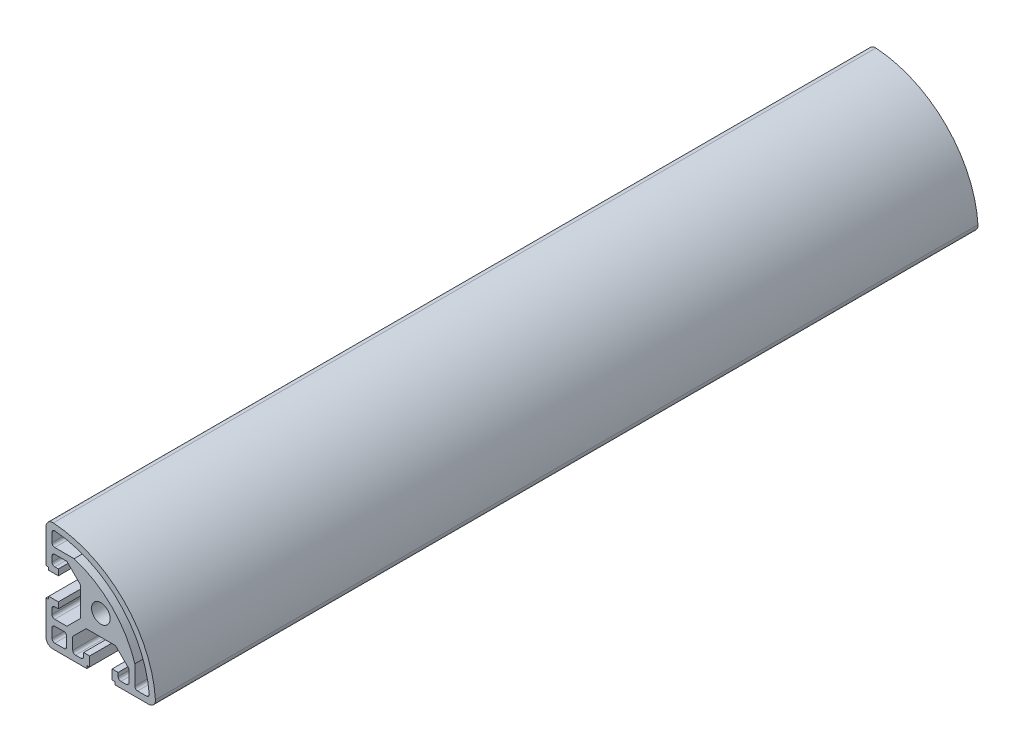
ISO-10303-21;
HEADER;
FILE_DESCRIPTION(('STEP AP214'),'2;1');
FILE_NAME('part.step','',(''),(''),'','','');
FILE_SCHEMA(('AUTOMOTIVE_DESIGN { 1 0 10303 214 1 1 1 1 }'));
ENDSEC;
DATA;
#1=APPLICATION_CONTEXT('core data for automotive mechanical design processes');
#2=APPLICATION_PROTOCOL_DEFINITION('international standard','automotive_design',2000,#1);
#3=PRODUCT_CONTEXT('',#1,'mechanical');
#4=PRODUCT('Part','Part','',(#3));
#5=PRODUCT_RELATED_PRODUCT_CATEGORY('part','',(#4));
#6=PRODUCT_DEFINITION_FORMATION('','',#4);
#7=PRODUCT_DEFINITION_CONTEXT('part definition',#1,'design');
#8=PRODUCT_DEFINITION('design','',#6,#7);
#9=PRODUCT_DEFINITION_SHAPE('','',#8);
#10=(LENGTH_UNIT() NAMED_UNIT(*) SI_UNIT(.MILLI.,.METRE.));
#11=(NAMED_UNIT(*) PLANE_ANGLE_UNIT() SI_UNIT($,.RADIAN.));
#12=(NAMED_UNIT(*) SI_UNIT($,.STERADIAN.) SOLID_ANGLE_UNIT());
#13=UNCERTAINTY_MEASURE_WITH_UNIT(LENGTH_MEASURE(1.E-05),#10,'distance_accuracy_value','');
#14=(GEOMETRIC_REPRESENTATION_CONTEXT(3) GLOBAL_UNCERTAINTY_ASSIGNED_CONTEXT((#13)) GLOBAL_UNIT_ASSIGNED_CONTEXT((#10,
#11,#12)) REPRESENTATION_CONTEXT('',''));
#15=CARTESIAN_POINT('',(0.,0.,0.));
#16=DIRECTION('',(0.,0.,1.));
#17=DIRECTION('',(1.,0.,0.));
#18=AXIS2_PLACEMENT_3D('',#15,#16,#17);
#19=CARTESIAN_POINT('',(17.4165738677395,-17.4999999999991,150.));
#20=DIRECTION('',(0.,0.,1.));
#21=DIRECTION('',(1.,0.,0.));
#22=AXIS2_PLACEMENT_3D('',#19,#20,#21);
#23=PLANE('',#22);
#24=CARTESIAN_POINT('',(-20.,-20.0000000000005,150.));
#25=DIRECTION('',(0.,0.,1.));
#26=DIRECTION('',(1.,0.,0.));
#27=AXIS2_PLACEMENT_3D('',#24,#25,#26);
#28=CIRCLE('',#27,37.7999999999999);
#29=CARTESIAN_POINT('',(17.6568979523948,-16.7139633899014,150.));
#30=VERTEX_POINT('',#29);
#31=CARTESIAN_POINT('',(-16.7139633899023,17.6568979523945,150.));
#32=VERTEX_POINT('',#31);
#33=EDGE_CURVE('E468',#30,#32,#28,.T.);
#34=ORIENTED_EDGE('',*,*,#33,.F.);
#35=CARTESIAN_POINT('',(16.6606837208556,-16.8008955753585,150.));
#36=DIRECTION('',(0.,0.,1.));
#37=DIRECTION('',(1.,0.,0.));
#38=AXIS2_PLACEMENT_3D('',#35,#36,#37);
#39=CIRCLE('',#38,0.999999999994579);
#40=CARTESIAN_POINT('',(16.6606837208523,-17.8008955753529,150.));
#41=VERTEX_POINT('',#40);
#42=EDGE_CURVE('E460',#41,#30,#39,.T.);
#43=ORIENTED_EDGE('',*,*,#42,.F.);
#44=DIRECTION('',(1.,1.56968946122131E-13,0.));
#45=VECTOR('',#44,1.);
#46=CARTESIAN_POINT('',(13.4115779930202,-17.8008955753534,150.));
#47=LINE('',#46,#45);
#48=CARTESIAN_POINT('',(13.4115779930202,-17.8008955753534,150.));
#49=VERTEX_POINT('',#48);
#50=EDGE_CURVE('E499',#49,#41,#47,.T.);
#51=ORIENTED_EDGE('',*,*,#50,.F.);
#52=CARTESIAN_POINT('',(13.4115779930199,-16.8008955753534,150.));
#53=DIRECTION('',(0.,0.,1.));
#54=DIRECTION('',(1.,0.,0.));
#55=AXIS2_PLACEMENT_3D('',#52,#53,#54);
#56=CIRCLE('',#55,1.);
#57=CARTESIAN_POINT('',(12.4115779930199,-16.8008955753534,150.));
#58=VERTEX_POINT('',#57);
#59=EDGE_CURVE('E497',#58,#49,#56,.T.);
#60=ORIENTED_EDGE('',*,*,#59,.F.);
#61=DIRECTION('',(0.,-1.,0.));
#62=VECTOR('',#61,1.);
#63=CARTESIAN_POINT('',(12.4115779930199,-9.72918640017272,150.));
#64=LINE('',#63,#62);
#65=CARTESIAN_POINT('',(12.4115779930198,-9.72918640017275,150.));
#66=VERTEX_POINT('',#65);
#67=EDGE_CURVE('E495',#66,#58,#64,.T.);
#68=ORIENTED_EDGE('',*,*,#67,.F.);
#69=CARTESIAN_POINT('',(-20.,-20.0000000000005,150.));
#70=DIRECTION('',(0.,0.,-1.));
#71=DIRECTION('',(1.,0.,0.));
#72=AXIS2_PLACEMENT_3D('',#69,#70,#71);
#73=CIRCLE('',#72,34.0000000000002);
#74=CARTESIAN_POINT('',(-9.72918640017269,12.4115779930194,150.));
#75=VERTEX_POINT('',#74);
#76=EDGE_CURVE('E493',#75,#66,#73,.T.);
#77=ORIENTED_EDGE('',*,*,#76,.F.);
#78=DIRECTION('',(1.,0.,0.));
#79=VECTOR('',#78,1.);
#80=CARTESIAN_POINT('',(-16.8008955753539,12.4115779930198,150.));
#81=LINE('',#80,#79);
#82=CARTESIAN_POINT('',(-16.8008955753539,12.4115779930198,150.));
#83=VERTEX_POINT('',#82);
#84=EDGE_CURVE('E491',#83,#75,#81,.T.);
#85=ORIENTED_EDGE('',*,*,#84,.F.);
#86=CARTESIAN_POINT('',(-16.8008955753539,13.4115779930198,150.));
#87=DIRECTION('',(0.,0.,1.));
#88=DIRECTION('',(1.,0.,0.));
#89=AXIS2_PLACEMENT_3D('',#86,#87,#88);
#90=CIRCLE('',#89,1.00000000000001);
#91=CARTESIAN_POINT('',(-17.8008955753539,13.4115779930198,150.));
#92=VERTEX_POINT('',#91);
#93=EDGE_CURVE('E489',#92,#83,#90,.T.);
#94=ORIENTED_EDGE('',*,*,#93,.F.);
#95=DIRECTION('',(0.,-1.,0.));
#96=VECTOR('',#95,1.);
#97=CARTESIAN_POINT('',(-17.8008955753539,16.6606837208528,150.));
#98=LINE('',#97,#96);
#99=CARTESIAN_POINT('',(-17.8008955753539,16.6606837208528,150.));
#100=VERTEX_POINT('',#99);
#101=EDGE_CURVE('E484',#100,#92,#98,.T.);
#102=ORIENTED_EDGE('',*,*,#101,.F.);
#103=CARTESIAN_POINT('',(-16.8008955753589,16.660683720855,150.));
#104=DIRECTION('',(0.,0.,1.));
#105=DIRECTION('',(1.,0.,0.));
#106=AXIS2_PLACEMENT_3D('',#103,#104,#105);
#107=CIRCLE('',#106,0.999999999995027);
#108=EDGE_CURVE('E482',#32,#100,#107,.T.);
#109=ORIENTED_EDGE('',*,*,#108,.F.);
#110=EDGE_LOOP('',(#34,#43,#51,#60,#68,#77,#85,#94,#102,#109));
#111=FACE_BOUND('',#110,.T.);
#112=CARTESIAN_POINT('',(17.4165738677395,-17.4999999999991,150.));
#113=DIRECTION('',(0.,0.,1.));
#114=DIRECTION('',(1.,0.,0.));
#115=AXIS2_PLACEMENT_3D('',#112,#113,#114);
#116=CIRCLE('',#115,2.50000000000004);
#117=CARTESIAN_POINT('',(17.4165738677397,-19.9999999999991,150.));
#118=VERTEX_POINT('',#117);
#119=CARTESIAN_POINT('',(19.9110121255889,-17.3333333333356,150.));
#120=VERTEX_POINT('',#119);
#121=EDGE_CURVE('E601',#118,#120,#116,.T.);
#122=ORIENTED_EDGE('',*,*,#121,.T.);
#123=CARTESIAN_POINT('',(-20.,-20.0000000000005,150.));
#124=DIRECTION('',(0.,0.,1.));
#125=DIRECTION('',(1.,0.,0.));
#126=AXIS2_PLACEMENT_3D('',#123,#124,#125);
#127=CIRCLE('',#126,40.0000000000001);
#128=CARTESIAN_POINT('',(-17.3333333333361,19.9110121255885,150.));
#129=VERTEX_POINT('',#128);
#130=EDGE_CURVE('E604',#120,#129,#127,.T.);
#131=ORIENTED_EDGE('',*,*,#130,.T.);
#132=CARTESIAN_POINT('',(-17.5,17.4165738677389,150.));
#133=DIRECTION('',(0.,0.,1.));
#134=DIRECTION('',(1.,0.,0.));
#135=AXIS2_PLACEMENT_3D('',#132,#133,#134);
#136=CIRCLE('',#135,2.49999999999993);
#137=CARTESIAN_POINT('',(-19.9999999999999,17.4165738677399,150.));
#138=VERTEX_POINT('',#137);
#139=EDGE_CURVE('E607',#129,#138,#136,.T.);
#140=ORIENTED_EDGE('',*,*,#139,.T.);
#141=DIRECTION('',(0.,-1.,0.));
#142=VECTOR('',#141,1.);
#143=CARTESIAN_POINT('',(-19.9999999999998,17.4165738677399,150.));
#144=LINE('',#143,#142);
#145=CARTESIAN_POINT('',(-19.9999999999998,5.10000000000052,150.));
#146=VERTEX_POINT('',#145);
#147=EDGE_CURVE('E609',#138,#146,#144,.T.);
#148=ORIENTED_EDGE('',*,*,#147,.T.);
#149=DIRECTION('',(1.,0.,0.));
#150=VECTOR('',#149,1.);
#151=CARTESIAN_POINT('',(-19.9999999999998,5.10000000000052,150.));
#152=LINE('',#151,#150);
#153=CARTESIAN_POINT('',(-18.9999999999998,5.10000000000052,150.));
#154=VERTEX_POINT('',#153);
#155=EDGE_CURVE('E611',#146,#154,#152,.T.);
#156=ORIENTED_EDGE('',*,*,#155,.T.);
#157=DIRECTION('',(0.,-1.,0.));
#158=VECTOR('',#157,1.);
#159=CARTESIAN_POINT('',(-18.9999999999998,5.10000000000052,150.));
#160=LINE('',#159,#158);
#161=CARTESIAN_POINT('',(-18.9999999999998,4.10000000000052,150.));
#162=VERTEX_POINT('',#161);
#163=EDGE_CURVE('E613',#154,#162,#160,.T.);
#164=ORIENTED_EDGE('',*,*,#163,.T.);
#165=DIRECTION('',(1.,0.,0.));
#166=VECTOR('',#165,1.);
#167=CARTESIAN_POINT('',(-18.9999999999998,4.10000000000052,150.));
#168=LINE('',#167,#166);
#169=CARTESIAN_POINT('',(-15.4999999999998,4.10000000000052,150.));
#170=VERTEX_POINT('',#169);
#171=EDGE_CURVE('E615',#162,#170,#168,.T.);
#172=ORIENTED_EDGE('',*,*,#171,.T.);
#173=DIRECTION('',(0.,1.,0.));
#174=VECTOR('',#173,1.);
#175=CARTESIAN_POINT('',(-15.4999999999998,4.10000000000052,150.));
#176=LINE('',#175,#174);
#177=CARTESIAN_POINT('',(-15.4999999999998,6.30000000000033,150.));
#178=VERTEX_POINT('',#177);
#179=EDGE_CURVE('E617',#170,#178,#176,.T.);
#180=ORIENTED_EDGE('',*,*,#179,.T.);
#181=DIRECTION('',(-1.,0.,0.));
#182=VECTOR('',#181,1.);
#183=CARTESIAN_POINT('',(-15.4999999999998,6.30000000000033,150.));
#184=LINE('',#183,#182);
#185=CARTESIAN_POINT('',(-16.7999999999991,6.30000000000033,150.));
#186=VERTEX_POINT('',#185);
#187=EDGE_CURVE('E619',#178,#186,#184,.T.);
#188=ORIENTED_EDGE('',*,*,#187,.T.);
#189=CARTESIAN_POINT('',(-16.7999999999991,7.30000000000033,150.));
#190=DIRECTION('',(0.,0.,-1.));
#191=DIRECTION('',(1.,0.,0.));
#192=AXIS2_PLACEMENT_3D('',#189,#190,#191);
#193=CIRCLE('',#192,1.);
#194=CARTESIAN_POINT('',(-17.7999999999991,7.30000000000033,150.));
#195=VERTEX_POINT('',#194);
#196=EDGE_CURVE('E621',#186,#195,#193,.T.);
#197=ORIENTED_EDGE('',*,*,#196,.T.);
#198=DIRECTION('',(0.,1.,0.));
#199=VECTOR('',#198,1.);
#200=CARTESIAN_POINT('',(-17.7999999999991,9.25000000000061,150.));
#201=LINE('',#200,#199);
#202=CARTESIAN_POINT('',(-17.7999999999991,9.25000000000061,150.));
#203=VERTEX_POINT('',#202);
#204=EDGE_CURVE('E623',#195,#203,#201,.T.);
#205=ORIENTED_EDGE('',*,*,#204,.T.);
#206=CARTESIAN_POINT('',(-16.7999999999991,9.25000000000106,150.));
#207=DIRECTION('',(0.,0.,-1.));
#208=DIRECTION('',(1.,0.,0.));
#209=AXIS2_PLACEMENT_3D('',#206,#207,#208);
#210=CIRCLE('',#209,1.);
#211=CARTESIAN_POINT('',(-16.7999999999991,10.2500000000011,150.));
#212=VERTEX_POINT('',#211);
#213=EDGE_CURVE('E625',#203,#212,#210,.T.);
#214=ORIENTED_EDGE('',*,*,#213,.T.);
#215=DIRECTION('',(1.,0.,0.));
#216=VECTOR('',#215,1.);
#217=CARTESIAN_POINT('',(-16.7999999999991,10.2500000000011,150.));
#218=LINE('',#217,#216);
#219=CARTESIAN_POINT('',(-12.3713203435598,10.2500000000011,150.));
#220=VERTEX_POINT('',#219);
#221=EDGE_CURVE('E627',#212,#220,#218,.T.);
#222=ORIENTED_EDGE('',*,*,#221,.T.);
#223=DIRECTION('',(0.707106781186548,-0.707106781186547,0.));
#224=VECTOR('',#223,1.);
#225=CARTESIAN_POINT('',(-12.3713203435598,10.2500000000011,150.));
#226=LINE('',#225,#224);
#227=CARTESIAN_POINT('',(-7.49999999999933,5.37867965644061,150.));
#228=VERTEX_POINT('',#227);
#229=EDGE_CURVE('E629',#220,#228,#226,.T.);
#230=ORIENTED_EDGE('',*,*,#229,.T.);
#231=DIRECTION('',(0.,-1.,0.));
#232=VECTOR('',#231,1.);
#233=CARTESIAN_POINT('',(-7.49999999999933,1.51961776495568E-12,150.));
#234=LINE('',#233,#232);
#235=CARTESIAN_POINT('',(-7.49999999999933,-5.37867965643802,150.));
#236=VERTEX_POINT('',#235);
#237=EDGE_CURVE('E631',#228,#236,#234,.T.);
#238=ORIENTED_EDGE('',*,*,#237,.T.);
#239=DIRECTION('',(-0.707106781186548,-0.707106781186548,0.));
#240=VECTOR('',#239,1.);
#241=CARTESIAN_POINT('',(-12.3713203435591,-10.2499999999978,150.));
#242=LINE('',#241,#240);
#243=CARTESIAN_POINT('',(-12.3713203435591,-10.2499999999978,150.));
#244=VERTEX_POINT('',#243);
#245=EDGE_CURVE('E633',#236,#244,#242,.T.);
#246=ORIENTED_EDGE('',*,*,#245,.T.);
#247=DIRECTION('',(-1.,0.,0.));
#248=VECTOR('',#247,1.);
#249=CARTESIAN_POINT('',(-16.7999999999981,-10.2499999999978,150.));
#250=LINE('',#249,#248);
#251=CARTESIAN_POINT('',(-16.7999999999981,-10.2499999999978,150.));
#252=VERTEX_POINT('',#251);
#253=EDGE_CURVE('E635',#244,#252,#250,.T.);
#254=ORIENTED_EDGE('',*,*,#253,.T.);
#255=CARTESIAN_POINT('',(-16.7999999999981,-9.2499999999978,150.));
#256=DIRECTION('',(0.,0.,-1.));
#257=DIRECTION('',(1.,0.,0.));
#258=AXIS2_PLACEMENT_3D('',#255,#256,#257);
#259=CIRCLE('',#258,1.);
#260=CARTESIAN_POINT('',(-17.7999999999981,-9.24999999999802,150.));
#261=VERTEX_POINT('',#260);
#262=EDGE_CURVE('E637',#252,#261,#259,.T.);
#263=ORIENTED_EDGE('',*,*,#262,.T.);
#264=DIRECTION('',(0.,1.,0.));
#265=VECTOR('',#264,1.);
#266=CARTESIAN_POINT('',(-17.7999999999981,-9.24999999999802,150.));
#267=LINE('',#266,#265);
#268=CARTESIAN_POINT('',(-17.7999999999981,-7.29999999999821,150.));
#269=VERTEX_POINT('',#268);
#270=EDGE_CURVE('E639',#261,#269,#267,.T.);
#271=ORIENTED_EDGE('',*,*,#270,.T.);
#272=CARTESIAN_POINT('',(-16.7999999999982,-7.29999999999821,150.));
#273=DIRECTION('',(0.,0.,-1.));
#274=DIRECTION('',(1.,0.,0.));
#275=AXIS2_PLACEMENT_3D('',#272,#273,#274);
#276=CIRCLE('',#275,0.999999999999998);
#277=CARTESIAN_POINT('',(-16.7999999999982,-6.29999999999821,150.));
#278=VERTEX_POINT('',#277);
#279=EDGE_CURVE('E641',#269,#278,#276,.T.);
#280=ORIENTED_EDGE('',*,*,#279,.T.);
#281=DIRECTION('',(1.,0.,0.));
#282=VECTOR('',#281,1.);
#283=CARTESIAN_POINT('',(-15.4999999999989,-6.29999999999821,150.));
#284=LINE('',#283,#282);
#285=CARTESIAN_POINT('',(-15.4999999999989,-6.29999999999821,150.));
#286=VERTEX_POINT('',#285);
#287=EDGE_CURVE('E643',#278,#286,#284,.T.);
#288=ORIENTED_EDGE('',*,*,#287,.T.);
#289=DIRECTION('',(0.,1.,0.));
#290=VECTOR('',#289,1.);
#291=CARTESIAN_POINT('',(-15.4999999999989,-4.09999999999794,150.));
#292=LINE('',#291,#290);
#293=CARTESIAN_POINT('',(-15.4999999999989,-4.09999999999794,150.));
#294=VERTEX_POINT('',#293);
#295=EDGE_CURVE('E645',#286,#294,#292,.T.);
#296=ORIENTED_EDGE('',*,*,#295,.T.);
#297=DIRECTION('',(-1.,0.,0.));
#298=VECTOR('',#297,1.);
#299=CARTESIAN_POINT('',(-18.9999999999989,-4.09999999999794,150.));
#300=LINE('',#299,#298);
#301=CARTESIAN_POINT('',(-18.9999999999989,-4.09999999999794,150.));
#302=VERTEX_POINT('',#301);
#303=EDGE_CURVE('E647',#294,#302,#300,.T.);
#304=ORIENTED_EDGE('',*,*,#303,.T.);
#305=DIRECTION('',(0.,-1.,0.));
#306=VECTOR('',#305,1.);
#307=CARTESIAN_POINT('',(-18.9999999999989,-5.09999999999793,150.));
#308=LINE('',#307,#306);
#309=CARTESIAN_POINT('',(-18.9999999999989,-5.09999999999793,150.));
#310=VERTEX_POINT('',#309);
#311=EDGE_CURVE('E649',#302,#310,#308,.T.);
#312=ORIENTED_EDGE('',*,*,#311,.T.);
#313=DIRECTION('',(-1.,0.,0.));
#314=VECTOR('',#313,1.);
#315=CARTESIAN_POINT('',(-19.9999999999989,-5.09999999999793,150.));
#316=LINE('',#315,#314);
#317=CARTESIAN_POINT('',(-19.9999999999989,-5.09999999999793,150.));
#318=VERTEX_POINT('',#317);
#319=EDGE_CURVE('E651',#310,#318,#316,.T.);
#320=ORIENTED_EDGE('',*,*,#319,.T.);
#321=DIRECTION('',(0.,-1.,0.));
#322=VECTOR('',#321,1.);
#323=CARTESIAN_POINT('',(-19.9999999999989,-5.09999999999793,150.));
#324=LINE('',#323,#322);
#325=CARTESIAN_POINT('',(-19.9999999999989,-17.4999999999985,150.));
#326=VERTEX_POINT('',#325);
#327=EDGE_CURVE('E653',#318,#326,#324,.T.);
#328=ORIENTED_EDGE('',*,*,#327,.T.);
#329=CARTESIAN_POINT('',(-17.4999999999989,-17.4999999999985,150.));
#330=DIRECTION('',(0.,0.,1.));
#331=DIRECTION('',(1.,0.,0.));
#332=AXIS2_PLACEMENT_3D('',#329,#330,#331);
#333=CIRCLE('',#332,2.5);
#334=CARTESIAN_POINT('',(-17.4999999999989,-19.9999999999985,150.));
#335=VERTEX_POINT('',#334);
#336=EDGE_CURVE('E655',#326,#335,#333,.T.);
#337=ORIENTED_EDGE('',*,*,#336,.T.);
#338=DIRECTION('',(1.,0.,0.));
#339=VECTOR('',#338,1.);
#340=CARTESIAN_POINT('',(-5.09999999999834,-19.9999999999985,150.));
#341=LINE('',#340,#339);
#342=CARTESIAN_POINT('',(-5.09999999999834,-19.9999999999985,150.));
#343=VERTEX_POINT('',#342);
#344=EDGE_CURVE('E657',#335,#343,#341,.T.);
#345=ORIENTED_EDGE('',*,*,#344,.T.);
#346=DIRECTION('',(0.,1.,0.));
#347=VECTOR('',#346,1.);
#348=CARTESIAN_POINT('',(-5.09999999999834,-19.9999999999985,150.));
#349=LINE('',#348,#347);
#350=CARTESIAN_POINT('',(-5.09999999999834,-18.9999999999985,150.));
#351=VERTEX_POINT('',#350);
#352=EDGE_CURVE('E659',#343,#351,#349,.T.);
#353=ORIENTED_EDGE('',*,*,#352,.T.);
#354=DIRECTION('',(1.,0.,0.));
#355=VECTOR('',#354,1.);
#356=CARTESIAN_POINT('',(-5.09999999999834,-18.9999999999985,150.));
#357=LINE('',#356,#355);
#358=CARTESIAN_POINT('',(-4.09999999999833,-18.9999999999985,150.));
#359=VERTEX_POINT('',#358);
#360=EDGE_CURVE('E661',#351,#359,#357,.T.);
#361=ORIENTED_EDGE('',*,*,#360,.T.);
#362=DIRECTION('',(0.,1.,0.));
#363=VECTOR('',#362,1.);
#364=CARTESIAN_POINT('',(-4.09999999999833,-18.9999999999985,150.));
#365=LINE('',#364,#363);
#366=CARTESIAN_POINT('',(-4.09999999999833,-15.4999999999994,150.));
#367=VERTEX_POINT('',#366);
#368=EDGE_CURVE('E663',#359,#367,#365,.T.);
#369=ORIENTED_EDGE('',*,*,#368,.T.);
#370=DIRECTION('',(-1.,0.,0.));
#371=VECTOR('',#370,1.);
#372=CARTESIAN_POINT('',(-4.09999999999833,-15.4999999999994,150.));
#373=LINE('',#372,#371);
#374=CARTESIAN_POINT('',(-6.29999999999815,-15.4999999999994,150.));
#375=VERTEX_POINT('',#374);
#376=EDGE_CURVE('E665',#367,#375,#373,.T.);
#377=ORIENTED_EDGE('',*,*,#376,.T.);
#378=DIRECTION('',(0.,-1.,0.));
#379=VECTOR('',#378,1.);
#380=CARTESIAN_POINT('',(-6.29999999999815,-15.4999999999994,150.));
#381=LINE('',#380,#379);
#382=CARTESIAN_POINT('',(-6.29999999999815,-16.7999999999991,150.));
#383=VERTEX_POINT('',#382);
#384=EDGE_CURVE('E667',#375,#383,#381,.T.);
#385=ORIENTED_EDGE('',*,*,#384,.T.);
#386=CARTESIAN_POINT('',(-7.29999999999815,-16.7999999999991,150.));
#387=DIRECTION('',(0.,0.,-1.));
#388=DIRECTION('',(1.,0.,0.));
#389=AXIS2_PLACEMENT_3D('',#386,#387,#388);
#390=CIRCLE('',#389,1.);
#391=CARTESIAN_POINT('',(-7.29999999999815,-17.7999999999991,150.));
#392=VERTEX_POINT('',#391);
#393=EDGE_CURVE('E669',#383,#392,#390,.T.);
#394=ORIENTED_EDGE('',*,*,#393,.T.);
#395=DIRECTION('',(-1.,0.,0.));
#396=VECTOR('',#395,1.);
#397=CARTESIAN_POINT('',(-9.24999999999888,-17.7999999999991,150.));
#398=LINE('',#397,#396);
#399=CARTESIAN_POINT('',(-9.24999999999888,-17.7999999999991,150.));
#400=VERTEX_POINT('',#399);
#401=EDGE_CURVE('E671',#392,#400,#398,.T.);
#402=ORIENTED_EDGE('',*,*,#401,.T.);
#403=CARTESIAN_POINT('',(-9.24999999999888,-16.7999999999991,150.));
#404=DIRECTION('',(0.,0.,-1.));
#405=DIRECTION('',(1.,0.,0.));
#406=AXIS2_PLACEMENT_3D('',#403,#404,#405);
#407=CIRCLE('',#406,1.);
#408=CARTESIAN_POINT('',(-10.2499999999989,-16.7999999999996,150.));
#409=VERTEX_POINT('',#408);
#410=EDGE_CURVE('E673',#400,#409,#407,.T.);
#411=ORIENTED_EDGE('',*,*,#410,.T.);
#412=DIRECTION('',(0.,1.,0.));
#413=VECTOR('',#412,1.);
#414=CARTESIAN_POINT('',(-10.2499999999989,-16.7999999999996,150.));
#415=LINE('',#414,#413);
#416=CARTESIAN_POINT('',(-10.2499999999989,-12.3713203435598,150.));
#417=VERTEX_POINT('',#416);
#418=EDGE_CURVE('E675',#409,#417,#415,.T.);
#419=ORIENTED_EDGE('',*,*,#418,.T.);
#420=DIRECTION('',(0.707106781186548,0.707106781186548,0.));
#421=VECTOR('',#420,1.);
#422=CARTESIAN_POINT('',(-10.2499999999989,-12.3713203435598,150.));
#423=LINE('',#422,#421);
#424=CARTESIAN_POINT('',(-5.37867965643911,-7.50000000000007,150.));
#425=VERTEX_POINT('',#424);
#426=EDGE_CURVE('E677',#417,#425,#423,.T.);
#427=ORIENTED_EDGE('',*,*,#426,.T.);
#428=DIRECTION('',(1.,1.21266940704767E-13,0.));
#429=VECTOR('',#428,1.);
#430=CARTESIAN_POINT('',(-4.9960036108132E-13,-7.49999999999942,150.));
#431=LINE('',#430,#429);
#432=CARTESIAN_POINT('',(5.37867965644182,-7.5,150.));
#433=VERTEX_POINT('',#432);
#434=EDGE_CURVE('E679',#425,#433,#431,.T.);
#435=ORIENTED_EDGE('',*,*,#434,.T.);
#436=DIRECTION('',(0.70710678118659,-0.707106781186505,0.));
#437=VECTOR('',#436,1.);
#438=CARTESIAN_POINT('',(10.250000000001,-12.3713203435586,150.));
#439=LINE('',#438,#437);
#440=CARTESIAN_POINT('',(10.250000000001,-12.3713203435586,150.));
#441=VERTEX_POINT('',#440);
#442=EDGE_CURVE('E681',#433,#441,#439,.T.);
#443=ORIENTED_EDGE('',*,*,#442,.T.);
#444=DIRECTION('',(0.,-1.,0.));
#445=VECTOR('',#444,1.);
#446=CARTESIAN_POINT('',(10.250000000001,-16.7999999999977,150.));
#447=LINE('',#446,#445);
#448=CARTESIAN_POINT('',(10.250000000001,-16.7999999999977,150.));
#449=VERTEX_POINT('',#448);
#450=EDGE_CURVE('E683',#441,#449,#447,.T.);
#451=ORIENTED_EDGE('',*,*,#450,.T.);
#452=CARTESIAN_POINT('',(9.25000000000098,-16.7999999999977,150.));
#453=DIRECTION('',(0.,0.,-1.));
#454=DIRECTION('',(1.,0.,0.));
#455=AXIS2_PLACEMENT_3D('',#452,#453,#454);
#456=CIRCLE('',#455,0.999999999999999);
#457=CARTESIAN_POINT('',(9.25000000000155,-17.7999999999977,150.));
#458=VERTEX_POINT('',#457);
#459=EDGE_CURVE('E685',#449,#458,#456,.T.);
#460=ORIENTED_EDGE('',*,*,#459,.T.);
#461=DIRECTION('',(-1.,0.,0.));
#462=VECTOR('',#461,1.);
#463=CARTESIAN_POINT('',(9.25000000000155,-17.7999999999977,150.));
#464=LINE('',#463,#462);
#465=CARTESIAN_POINT('',(7.30000000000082,-17.7999999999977,150.));
#466=VERTEX_POINT('',#465);
#467=EDGE_CURVE('E687',#458,#466,#464,.T.);
#468=ORIENTED_EDGE('',*,*,#467,.T.);
#469=CARTESIAN_POINT('',(7.30000000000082,-16.7999999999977,150.));
#470=DIRECTION('',(0.,0.,-1.));
#471=DIRECTION('',(1.,0.,0.));
#472=AXIS2_PLACEMENT_3D('',#469,#470,#471);
#473=CIRCLE('',#472,0.999999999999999);
#474=CARTESIAN_POINT('',(6.30000000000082,-16.7999999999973,150.));
#475=VERTEX_POINT('',#474);
#476=EDGE_CURVE('E689',#466,#475,#473,.T.);
#477=ORIENTED_EDGE('',*,*,#476,.T.);
#478=DIRECTION('',(-1.97491595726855E-13,1.,0.));
#479=VECTOR('',#478,1.);
#480=CARTESIAN_POINT('',(6.30000000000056,-15.499999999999,150.));
#481=LINE('',#480,#479);
#482=CARTESIAN_POINT('',(6.30000000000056,-15.499999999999,150.));
#483=VERTEX_POINT('',#482);
#484=EDGE_CURVE('E691',#475,#483,#481,.T.);
#485=ORIENTED_EDGE('',*,*,#484,.T.);
#486=DIRECTION('',(-1.,0.,0.));
#487=VECTOR('',#486,1.);
#488=CARTESIAN_POINT('',(4.09999999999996,-15.499999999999,150.));
#489=LINE('',#488,#487);
#490=CARTESIAN_POINT('',(4.09999999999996,-15.499999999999,150.));
#491=VERTEX_POINT('',#490);
#492=EDGE_CURVE('E693',#483,#491,#489,.T.);
#493=ORIENTED_EDGE('',*,*,#492,.T.);
#494=DIRECTION('',(0.,-1.,0.));
#495=VECTOR('',#494,1.);
#496=CARTESIAN_POINT('',(4.09999999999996,-18.9999999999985,150.));
#497=LINE('',#496,#495);
#498=CARTESIAN_POINT('',(4.09999999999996,-18.9999999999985,150.));
#499=VERTEX_POINT('',#498);
#500=EDGE_CURVE('E695',#491,#499,#497,.T.);
#501=ORIENTED_EDGE('',*,*,#500,.T.);
#502=DIRECTION('',(1.,-5.8286708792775E-13,0.));
#503=VECTOR('',#502,1.);
#504=CARTESIAN_POINT('',(5.10000000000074,-18.9999999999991,150.));
#505=LINE('',#504,#503);
#506=CARTESIAN_POINT('',(5.10000000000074,-18.9999999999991,150.));
#507=VERTEX_POINT('',#506);
#508=EDGE_CURVE('E697',#499,#507,#505,.T.);
#509=ORIENTED_EDGE('',*,*,#508,.T.);
#510=DIRECTION('',(0.,-1.,0.));
#511=VECTOR('',#510,1.);
#512=CARTESIAN_POINT('',(5.10000000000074,-19.9999999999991,150.));
#513=LINE('',#512,#511);
#514=CARTESIAN_POINT('',(5.10000000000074,-19.9999999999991,150.));
#515=VERTEX_POINT('',#514);
#516=EDGE_CURVE('E699',#507,#515,#513,.T.);
#517=ORIENTED_EDGE('',*,*,#516,.T.);
#518=DIRECTION('',(1.,0.,0.));
#519=VECTOR('',#518,1.);
#520=CARTESIAN_POINT('',(17.4165738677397,-19.9999999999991,150.));
#521=LINE('',#520,#519);
#522=EDGE_CURVE('E701',#515,#118,#521,.T.);
#523=ORIENTED_EDGE('',*,*,#522,.T.);
#524=EDGE_LOOP('',(#122,#131,#140,#148,#156,#164,#172,#180,#188,#197,#205,#214,#222,#230,#238,
#246,#254,#263,#271,#280,#288,#296,#304,#312,#320,#328,#337,#345,#353,#361,#369,#377,#385,#394,
#402,#411,#419,#427,#435,#443,#451,#460,#468,#477,#485,#493,#501,#509,#517,#523));
#525=FACE_BOUND('',#524,.T.);
#526=DIRECTION('',(0.,-1.,0.));
#527=VECTOR('',#526,1.);
#528=CARTESIAN_POINT('',(-17.7999999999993,-13.4500000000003,150.));
#529=LINE('',#528,#527);
#530=CARTESIAN_POINT('',(-17.7999999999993,-13.4500000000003,150.));
#531=VERTEX_POINT('',#530);
#532=CARTESIAN_POINT('',(-17.7999999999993,-16.8000000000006,150.));
#533=VERTEX_POINT('',#532);
#534=EDGE_CURVE('E544',#531,#533,#529,.T.);
#535=ORIENTED_EDGE('',*,*,#534,.F.);
#536=CARTESIAN_POINT('',(-16.7999999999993,-13.4500000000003,150.));
#537=DIRECTION('',(0.,0.,1.));
#538=DIRECTION('',(1.,0.,0.));
#539=AXIS2_PLACEMENT_3D('',#536,#537,#538);
#540=CIRCLE('',#539,1.);
#541=CARTESIAN_POINT('',(-16.7999999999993,-12.4500000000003,150.));
#542=VERTEX_POINT('',#541);
#543=EDGE_CURVE('E542',#542,#531,#540,.T.);
#544=ORIENTED_EDGE('',*,*,#543,.F.);
#545=DIRECTION('',(-1.,0.,0.));
#546=VECTOR('',#545,1.);
#547=CARTESIAN_POINT('',(-13.4499999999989,-12.4500000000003,150.));
#548=LINE('',#547,#546);
#549=CARTESIAN_POINT('',(-13.4499999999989,-12.4500000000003,150.));
#550=VERTEX_POINT('',#549);
#551=EDGE_CURVE('E558',#550,#542,#548,.T.);
#552=ORIENTED_EDGE('',*,*,#551,.F.);
#553=CARTESIAN_POINT('',(-13.4499999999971,-13.4500000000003,150.));
#554=DIRECTION('',(0.,0.,1.));
#555=DIRECTION('',(1.,0.,0.));
#556=AXIS2_PLACEMENT_3D('',#553,#554,#555);
#557=CIRCLE('',#556,0.999999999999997);
#558=CARTESIAN_POINT('',(-12.4499999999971,-13.4500000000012,150.));
#559=VERTEX_POINT('',#558);
#560=EDGE_CURVE('E555',#559,#550,#557,.T.);
#561=ORIENTED_EDGE('',*,*,#560,.F.);
#562=DIRECTION('',(0.,1.,0.));
#563=VECTOR('',#562,1.);
#564=CARTESIAN_POINT('',(-12.4499999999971,-16.8000000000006,150.));
#565=LINE('',#564,#563);
#566=CARTESIAN_POINT('',(-12.4499999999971,-16.8000000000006,150.));
#567=VERTEX_POINT('',#566);
#568=EDGE_CURVE('E553',#567,#559,#565,.T.);
#569=ORIENTED_EDGE('',*,*,#568,.F.);
#570=CARTESIAN_POINT('',(-13.4499999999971,-16.8000000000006,150.));
#571=DIRECTION('',(0.,0.,1.));
#572=DIRECTION('',(1.,0.,0.));
#573=AXIS2_PLACEMENT_3D('',#570,#571,#572);
#574=CIRCLE('',#573,0.999999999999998);
#575=CARTESIAN_POINT('',(-13.4499999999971,-17.8000000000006,150.));
#576=VERTEX_POINT('',#575);
#577=EDGE_CURVE('E551',#576,#567,#574,.T.);
#578=ORIENTED_EDGE('',*,*,#577,.F.);
#579=DIRECTION('',(1.,0.,0.));
#580=VECTOR('',#579,1.);
#581=CARTESIAN_POINT('',(-16.7999999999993,-17.8000000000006,150.));
#582=LINE('',#581,#580);
#583=CARTESIAN_POINT('',(-16.7999999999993,-17.8000000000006,150.));
#584=VERTEX_POINT('',#583);
#585=EDGE_CURVE('E549',#584,#576,#582,.T.);
#586=ORIENTED_EDGE('',*,*,#585,.F.);
#587=CARTESIAN_POINT('',(-16.7999999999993,-16.8000000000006,150.));
#588=DIRECTION('',(0.,0.,1.));
#589=DIRECTION('',(1.,0.,0.));
#590=AXIS2_PLACEMENT_3D('',#587,#588,#589);
#591=CIRCLE('',#590,0.999999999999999);
#592=EDGE_CURVE('E547',#533,#584,#591,.T.);
#593=ORIENTED_EDGE('',*,*,#592,.F.);
#594=EDGE_LOOP('',(#535,#544,#552,#561,#569,#578,#586,#593));
#595=FACE_BOUND('',#594,.T.);
#596=CARTESIAN_POINT('',(0.,0.,150.));
#597=DIRECTION('',(0.,0.,1.));
#598=DIRECTION('',(1.,0.,0.));
#599=AXIS2_PLACEMENT_3D('',#596,#597,#598);
#600=CIRCLE('',#599,3.4);
#601=CARTESIAN_POINT('',(3.4,0.,150.));
#602=VERTEX_POINT('',#601);
#603=EDGE_CURVE('E502',#602,#602,#600,.T.);
#604=ORIENTED_EDGE('',*,*,#603,.F.);
#605=EDGE_LOOP('',(#604));
#606=FACE_BOUND('',#605,.T.);
#607=ADVANCED_FACE('F35',(#111,#525,#595,#606),#23,.T.);
#608=CARTESIAN_POINT('',(17.4165738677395,-17.4999999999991,-150.));
#609=DIRECTION('',(0.,0.,1.));
#610=DIRECTION('',(1.,0.,0.));
#611=AXIS2_PLACEMENT_3D('',#608,#609,#610);
#612=PLANE('',#611);
#613=CARTESIAN_POINT('',(16.6606837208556,-16.8008955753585,-150.));
#614=DIRECTION('',(0.,0.,1.));
#615=DIRECTION('',(1.,0.,0.));
#616=AXIS2_PLACEMENT_3D('',#613,#614,#615);
#617=CIRCLE('',#616,0.999999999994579);
#618=CARTESIAN_POINT('',(16.6606837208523,-17.8008955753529,-150.));
#619=VERTEX_POINT('',#618);
#620=CARTESIAN_POINT('',(17.6568979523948,-16.7139633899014,-150.));
#621=VERTEX_POINT('',#620);
#622=EDGE_CURVE('E58',#619,#621,#617,.T.);
#623=ORIENTED_EDGE('',*,*,#622,.T.);
#624=CARTESIAN_POINT('',(-20.,-20.0000000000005,-150.));
#625=DIRECTION('',(0.,0.,1.));
#626=DIRECTION('',(1.,0.,0.));
#627=AXIS2_PLACEMENT_3D('',#624,#625,#626);
#628=CIRCLE('',#627,37.7999999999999);
#629=CARTESIAN_POINT('',(-16.7139633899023,17.6568979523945,-150.));
#630=VERTEX_POINT('',#629);
#631=EDGE_CURVE('E475',#621,#630,#628,.T.);
#632=ORIENTED_EDGE('',*,*,#631,.T.);
#633=CARTESIAN_POINT('',(-16.8008955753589,16.660683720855,-150.));
#634=DIRECTION('',(0.,0.,1.));
#635=DIRECTION('',(1.,0.,0.));
#636=AXIS2_PLACEMENT_3D('',#633,#634,#635);
#637=CIRCLE('',#636,0.999999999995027);
#638=CARTESIAN_POINT('',(-17.8008955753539,16.6606837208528,-150.));
#639=VERTEX_POINT('',#638);
#640=EDGE_CURVE('E504',#630,#639,#637,.T.);
#641=ORIENTED_EDGE('',*,*,#640,.T.);
#642=DIRECTION('',(0.,-1.,0.));
#643=VECTOR('',#642,1.);
#644=CARTESIAN_POINT('',(-17.8008955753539,16.6606837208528,-150.));
#645=LINE('',#644,#643);
#646=CARTESIAN_POINT('',(-17.8008955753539,13.4115779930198,-150.));
#647=VERTEX_POINT('',#646);
#648=EDGE_CURVE('E507',#639,#647,#645,.T.);
#649=ORIENTED_EDGE('',*,*,#648,.T.);
#650=CARTESIAN_POINT('',(-16.8008955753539,13.4115779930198,-150.));
#651=DIRECTION('',(0.,0.,1.));
#652=DIRECTION('',(1.,0.,0.));
#653=AXIS2_PLACEMENT_3D('',#650,#651,#652);
#654=CIRCLE('',#653,1.00000000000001);
#655=CARTESIAN_POINT('',(-16.8008955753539,12.4115779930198,-150.));
#656=VERTEX_POINT('',#655);
#657=EDGE_CURVE('E510',#647,#656,#654,.T.);
#658=ORIENTED_EDGE('',*,*,#657,.T.);
#659=DIRECTION('',(1.,0.,0.));
#660=VECTOR('',#659,1.);
#661=CARTESIAN_POINT('',(-16.8008955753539,12.4115779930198,-150.));
#662=LINE('',#661,#660);
#663=CARTESIAN_POINT('',(-9.72918640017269,12.4115779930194,-150.));
#664=VERTEX_POINT('',#663);
#665=EDGE_CURVE('E513',#656,#664,#662,.T.);
#666=ORIENTED_EDGE('',*,*,#665,.T.);
#667=CARTESIAN_POINT('',(-20.,-20.0000000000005,-150.));
#668=DIRECTION('',(0.,0.,-1.));
#669=DIRECTION('',(1.,0.,0.));
#670=AXIS2_PLACEMENT_3D('',#667,#668,#669);
#671=CIRCLE('',#670,34.0000000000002);
#672=CARTESIAN_POINT('',(12.4115779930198,-9.72918640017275,-150.));
#673=VERTEX_POINT('',#672);
#674=EDGE_CURVE('E516',#664,#673,#671,.T.);
#675=ORIENTED_EDGE('',*,*,#674,.T.);
#676=DIRECTION('',(0.,-1.,0.));
#677=VECTOR('',#676,1.);
#678=CARTESIAN_POINT('',(12.4115779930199,-9.72918640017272,-150.));
#679=LINE('',#678,#677);
#680=CARTESIAN_POINT('',(12.4115779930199,-16.8008955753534,-150.));
#681=VERTEX_POINT('',#680);
#682=EDGE_CURVE('E519',#673,#681,#679,.T.);
#683=ORIENTED_EDGE('',*,*,#682,.T.);
#684=CARTESIAN_POINT('',(13.4115779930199,-16.8008955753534,-150.));
#685=DIRECTION('',(0.,0.,1.));
#686=DIRECTION('',(1.,0.,0.));
#687=AXIS2_PLACEMENT_3D('',#684,#685,#686);
#688=CIRCLE('',#687,1.);
#689=CARTESIAN_POINT('',(13.4115779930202,-17.8008955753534,-150.));
#690=VERTEX_POINT('',#689);
#691=EDGE_CURVE('E522',#681,#690,#688,.T.);
#692=ORIENTED_EDGE('',*,*,#691,.T.);
#693=DIRECTION('',(1.,1.56968946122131E-13,0.));
#694=VECTOR('',#693,1.);
#695=CARTESIAN_POINT('',(13.4115779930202,-17.8008955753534,-150.));
#696=LINE('',#695,#694);
#697=EDGE_CURVE('E469',#690,#619,#696,.T.);
#698=ORIENTED_EDGE('',*,*,#697,.T.);
#699=EDGE_LOOP('',(#623,#632,#641,#649,#658,#666,#675,#683,#692,#698));
#700=FACE_BOUND('',#699,.T.);
#701=CARTESIAN_POINT('',(17.4165738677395,-17.4999999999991,-150.));
#702=DIRECTION('',(0.,0.,1.));
#703=DIRECTION('',(1.,0.,0.));
#704=AXIS2_PLACEMENT_3D('',#701,#702,#703);
#705=CIRCLE('',#704,2.50000000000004);
#706=CARTESIAN_POINT('',(17.4165738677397,-19.9999999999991,-150.));
#707=VERTEX_POINT('',#706);
#708=CARTESIAN_POINT('',(19.9110121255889,-17.3333333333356,-150.));
#709=VERTEX_POINT('',#708);
#710=EDGE_CURVE('E600',#707,#709,#705,.T.);
#711=ORIENTED_EDGE('',*,*,#710,.F.);
#712=DIRECTION('',(1.,0.,0.));
#713=VECTOR('',#712,1.);
#714=CARTESIAN_POINT('',(17.4165738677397,-19.9999999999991,-150.));
#715=LINE('',#714,#713);
#716=CARTESIAN_POINT('',(5.10000000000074,-19.9999999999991,-150.));
#717=VERTEX_POINT('',#716);
#718=EDGE_CURVE('E605',#717,#707,#715,.T.);
#719=ORIENTED_EDGE('',*,*,#718,.F.);
#720=DIRECTION('',(0.,-1.,0.));
#721=VECTOR('',#720,1.);
#722=CARTESIAN_POINT('',(5.10000000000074,-19.9999999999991,-150.));
#723=LINE('',#722,#721);
#724=CARTESIAN_POINT('',(5.10000000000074,-18.9999999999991,-150.));
#725=VERTEX_POINT('',#724);
#726=EDGE_CURVE('E802',#725,#717,#723,.T.);
#727=ORIENTED_EDGE('',*,*,#726,.F.);
#728=DIRECTION('',(1.,-5.8286708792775E-13,0.));
#729=VECTOR('',#728,1.);
#730=CARTESIAN_POINT('',(5.10000000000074,-18.9999999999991,-150.));
#731=LINE('',#730,#729);
#732=CARTESIAN_POINT('',(4.09999999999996,-18.9999999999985,-150.));
#733=VERTEX_POINT('',#732);
#734=EDGE_CURVE('E800',#733,#725,#731,.T.);
#735=ORIENTED_EDGE('',*,*,#734,.F.);
#736=DIRECTION('',(0.,-1.,0.));
#737=VECTOR('',#736,1.);
#738=CARTESIAN_POINT('',(4.09999999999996,-18.9999999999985,-150.));
#739=LINE('',#738,#737);
#740=CARTESIAN_POINT('',(4.09999999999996,-15.499999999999,-150.));
#741=VERTEX_POINT('',#740);
#742=EDGE_CURVE('E798',#741,#733,#739,.T.);
#743=ORIENTED_EDGE('',*,*,#742,.F.);
#744=DIRECTION('',(-1.,0.,0.));
#745=VECTOR('',#744,1.);
#746=CARTESIAN_POINT('',(4.09999999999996,-15.499999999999,-150.));
#747=LINE('',#746,#745);
#748=CARTESIAN_POINT('',(6.30000000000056,-15.499999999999,-150.));
#749=VERTEX_POINT('',#748);
#750=EDGE_CURVE('E796',#749,#741,#747,.T.);
#751=ORIENTED_EDGE('',*,*,#750,.F.);
#752=DIRECTION('',(-1.97491595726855E-13,1.,0.));
#753=VECTOR('',#752,1.);
#754=CARTESIAN_POINT('',(6.30000000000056,-15.499999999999,-150.));
#755=LINE('',#754,#753);
#756=CARTESIAN_POINT('',(6.30000000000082,-16.7999999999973,-150.));
#757=VERTEX_POINT('',#756);
#758=EDGE_CURVE('E794',#757,#749,#755,.T.);
#759=ORIENTED_EDGE('',*,*,#758,.F.);
#760=CARTESIAN_POINT('',(7.30000000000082,-16.7999999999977,-150.));
#761=DIRECTION('',(0.,0.,-1.));
#762=DIRECTION('',(1.,0.,0.));
#763=AXIS2_PLACEMENT_3D('',#760,#761,#762);
#764=CIRCLE('',#763,0.999999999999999);
#765=CARTESIAN_POINT('',(7.30000000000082,-17.7999999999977,-150.));
#766=VERTEX_POINT('',#765);
#767=EDGE_CURVE('E792',#766,#757,#764,.T.);
#768=ORIENTED_EDGE('',*,*,#767,.F.);
#769=DIRECTION('',(-1.,0.,0.));
#770=VECTOR('',#769,1.);
#771=CARTESIAN_POINT('',(9.25000000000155,-17.7999999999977,-150.));
#772=LINE('',#771,#770);
#773=CARTESIAN_POINT('',(9.25000000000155,-17.7999999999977,-150.));
#774=VERTEX_POINT('',#773);
#775=EDGE_CURVE('E790',#774,#766,#772,.T.);
#776=ORIENTED_EDGE('',*,*,#775,.F.);
#777=CARTESIAN_POINT('',(9.25000000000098,-16.7999999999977,-150.));
#778=DIRECTION('',(0.,0.,-1.));
#779=DIRECTION('',(1.,0.,0.));
#780=AXIS2_PLACEMENT_3D('',#777,#778,#779);
#781=CIRCLE('',#780,0.999999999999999);
#782=CARTESIAN_POINT('',(10.250000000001,-16.7999999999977,-150.));
#783=VERTEX_POINT('',#782);
#784=EDGE_CURVE('E788',#783,#774,#781,.T.);
#785=ORIENTED_EDGE('',*,*,#784,.F.);
#786=DIRECTION('',(0.,-1.,0.));
#787=VECTOR('',#786,1.);
#788=CARTESIAN_POINT('',(10.250000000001,-16.7999999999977,-150.));
#789=LINE('',#788,#787);
#790=CARTESIAN_POINT('',(10.250000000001,-12.3713203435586,-150.));
#791=VERTEX_POINT('',#790);
#792=EDGE_CURVE('E786',#791,#783,#789,.T.);
#793=ORIENTED_EDGE('',*,*,#792,.F.);
#794=DIRECTION('',(0.70710678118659,-0.707106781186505,0.));
#795=VECTOR('',#794,1.);
#796=CARTESIAN_POINT('',(10.250000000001,-12.3713203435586,-150.));
#797=LINE('',#796,#795);
#798=CARTESIAN_POINT('',(5.37867965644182,-7.5,-150.));
#799=VERTEX_POINT('',#798);
#800=EDGE_CURVE('E784',#799,#791,#797,.T.);
#801=ORIENTED_EDGE('',*,*,#800,.F.);
#802=DIRECTION('',(1.,-1.07398646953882E-13,0.));
#803=VECTOR('',#802,1.);
#804=CARTESIAN_POINT('',(-4.9960036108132E-13,-7.49999999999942,-150.));
#805=LINE('',#804,#803);
#806=CARTESIAN_POINT('',(-5.37867965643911,-7.50000000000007,-150.));
#807=VERTEX_POINT('',#806);
#808=EDGE_CURVE('E782',#807,#799,#805,.T.);
#809=ORIENTED_EDGE('',*,*,#808,.F.);
#810=DIRECTION('',(0.707106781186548,0.707106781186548,0.));
#811=VECTOR('',#810,1.);
#812=CARTESIAN_POINT('',(-10.2499999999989,-12.3713203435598,-150.));
#813=LINE('',#812,#811);
#814=CARTESIAN_POINT('',(-10.2499999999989,-12.3713203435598,-150.));
#815=VERTEX_POINT('',#814);
#816=EDGE_CURVE('E779',#815,#807,#813,.T.);
#817=ORIENTED_EDGE('',*,*,#816,.F.);
#818=DIRECTION('',(0.,1.,0.));
#819=VECTOR('',#818,1.);
#820=CARTESIAN_POINT('',(-10.2499999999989,-16.7999999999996,-150.));
#821=LINE('',#820,#819);
#822=CARTESIAN_POINT('',(-10.2499999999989,-16.7999999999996,-150.));
#823=VERTEX_POINT('',#822);
#824=EDGE_CURVE('E777',#823,#815,#821,.T.);
#825=ORIENTED_EDGE('',*,*,#824,.F.);
#826=CARTESIAN_POINT('',(-9.24999999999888,-16.7999999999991,-150.));
#827=DIRECTION('',(0.,0.,-1.));
#828=DIRECTION('',(1.,0.,0.));
#829=AXIS2_PLACEMENT_3D('',#826,#827,#828);
#830=CIRCLE('',#829,1.);
#831=CARTESIAN_POINT('',(-9.24999999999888,-17.7999999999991,-150.));
#832=VERTEX_POINT('',#831);
#833=EDGE_CURVE('E775',#832,#823,#830,.T.);
#834=ORIENTED_EDGE('',*,*,#833,.F.);
#835=DIRECTION('',(-1.,0.,0.));
#836=VECTOR('',#835,1.);
#837=CARTESIAN_POINT('',(-9.24999999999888,-17.7999999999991,-150.));
#838=LINE('',#837,#836);
#839=CARTESIAN_POINT('',(-7.29999999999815,-17.7999999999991,-150.));
#840=VERTEX_POINT('',#839);
#841=EDGE_CURVE('E773',#840,#832,#838,.T.);
#842=ORIENTED_EDGE('',*,*,#841,.F.);
#843=CARTESIAN_POINT('',(-7.29999999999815,-16.7999999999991,-150.));
#844=DIRECTION('',(0.,0.,-1.));
#845=DIRECTION('',(1.,0.,0.));
#846=AXIS2_PLACEMENT_3D('',#843,#844,#845);
#847=CIRCLE('',#846,1.);
#848=CARTESIAN_POINT('',(-6.29999999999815,-16.7999999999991,-150.));
#849=VERTEX_POINT('',#848);
#850=EDGE_CURVE('E771',#849,#840,#847,.T.);
#851=ORIENTED_EDGE('',*,*,#850,.F.);
#852=DIRECTION('',(0.,-1.,0.));
#853=VECTOR('',#852,1.);
#854=CARTESIAN_POINT('',(-6.29999999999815,-15.4999999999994,-150.));
#855=LINE('',#854,#853);
#856=CARTESIAN_POINT('',(-6.29999999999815,-15.4999999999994,-150.));
#857=VERTEX_POINT('',#856);
#858=EDGE_CURVE('E769',#857,#849,#855,.T.);
#859=ORIENTED_EDGE('',*,*,#858,.F.);
#860=DIRECTION('',(-1.,0.,0.));
#861=VECTOR('',#860,1.);
#862=CARTESIAN_POINT('',(-4.09999999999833,-15.4999999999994,-150.));
#863=LINE('',#862,#861);
#864=CARTESIAN_POINT('',(-4.09999999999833,-15.4999999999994,-150.));
#865=VERTEX_POINT('',#864);
#866=EDGE_CURVE('E767',#865,#857,#863,.T.);
#867=ORIENTED_EDGE('',*,*,#866,.F.);
#868=DIRECTION('',(0.,1.,0.));
#869=VECTOR('',#868,1.);
#870=CARTESIAN_POINT('',(-4.09999999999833,-18.9999999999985,-150.));
#871=LINE('',#870,#869);
#872=CARTESIAN_POINT('',(-4.09999999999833,-18.9999999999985,-150.));
#873=VERTEX_POINT('',#872);
#874=EDGE_CURVE('E765',#873,#865,#871,.T.);
#875=ORIENTED_EDGE('',*,*,#874,.F.);
#876=DIRECTION('',(1.,0.,0.));
#877=VECTOR('',#876,1.);
#878=CARTESIAN_POINT('',(-5.09999999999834,-18.9999999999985,-150.));
#879=LINE('',#878,#877);
#880=CARTESIAN_POINT('',(-5.09999999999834,-18.9999999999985,-150.));
#881=VERTEX_POINT('',#880);
#882=EDGE_CURVE('E763',#881,#873,#879,.T.);
#883=ORIENTED_EDGE('',*,*,#882,.F.);
#884=DIRECTION('',(0.,1.,0.));
#885=VECTOR('',#884,1.);
#886=CARTESIAN_POINT('',(-5.09999999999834,-19.9999999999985,-150.));
#887=LINE('',#886,#885);
#888=CARTESIAN_POINT('',(-5.09999999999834,-19.9999999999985,-150.));
#889=VERTEX_POINT('',#888);
#890=EDGE_CURVE('E761',#889,#881,#887,.T.);
#891=ORIENTED_EDGE('',*,*,#890,.F.);
#892=DIRECTION('',(1.,0.,0.));
#893=VECTOR('',#892,1.);
#894=CARTESIAN_POINT('',(-5.09999999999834,-19.9999999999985,-150.));
#895=LINE('',#894,#893);
#896=CARTESIAN_POINT('',(-17.4999999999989,-19.9999999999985,-150.));
#897=VERTEX_POINT('',#896);
#898=EDGE_CURVE('E759',#897,#889,#895,.T.);
#899=ORIENTED_EDGE('',*,*,#898,.F.);
#900=CARTESIAN_POINT('',(-17.4999999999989,-17.4999999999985,-150.));
#901=DIRECTION('',(0.,0.,1.));
#902=DIRECTION('',(1.,0.,0.));
#903=AXIS2_PLACEMENT_3D('',#900,#901,#902);
#904=CIRCLE('',#903,2.5);
#905=CARTESIAN_POINT('',(-19.9999999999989,-17.4999999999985,-150.));
#906=VERTEX_POINT('',#905);
#907=EDGE_CURVE('E757',#906,#897,#904,.T.);
#908=ORIENTED_EDGE('',*,*,#907,.F.);
#909=DIRECTION('',(0.,-1.,0.));
#910=VECTOR('',#909,1.);
#911=CARTESIAN_POINT('',(-19.9999999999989,-5.09999999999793,-150.));
#912=LINE('',#911,#910);
#913=CARTESIAN_POINT('',(-19.9999999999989,-5.09999999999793,-150.));
#914=VERTEX_POINT('',#913);
#915=EDGE_CURVE('E755',#914,#906,#912,.T.);
#916=ORIENTED_EDGE('',*,*,#915,.F.);
#917=DIRECTION('',(-1.,0.,0.));
#918=VECTOR('',#917,1.);
#919=CARTESIAN_POINT('',(-19.9999999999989,-5.09999999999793,-150.));
#920=LINE('',#919,#918);
#921=CARTESIAN_POINT('',(-18.9999999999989,-5.09999999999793,-150.));
#922=VERTEX_POINT('',#921);
#923=EDGE_CURVE('E753',#922,#914,#920,.T.);
#924=ORIENTED_EDGE('',*,*,#923,.F.);
#925=DIRECTION('',(0.,-1.,0.));
#926=VECTOR('',#925,1.);
#927=CARTESIAN_POINT('',(-18.9999999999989,-5.09999999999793,-150.));
#928=LINE('',#927,#926);
#929=CARTESIAN_POINT('',(-18.9999999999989,-4.09999999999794,-150.));
#930=VERTEX_POINT('',#929);
#931=EDGE_CURVE('E751',#930,#922,#928,.T.);
#932=ORIENTED_EDGE('',*,*,#931,.F.);
#933=DIRECTION('',(-1.,0.,0.));
#934=VECTOR('',#933,1.);
#935=CARTESIAN_POINT('',(-18.9999999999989,-4.09999999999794,-150.));
#936=LINE('',#935,#934);
#937=CARTESIAN_POINT('',(-15.4999999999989,-4.09999999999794,-150.));
#938=VERTEX_POINT('',#937);
#939=EDGE_CURVE('E749',#938,#930,#936,.T.);
#940=ORIENTED_EDGE('',*,*,#939,.F.);
#941=DIRECTION('',(0.,1.,0.));
#942=VECTOR('',#941,1.);
#943=CARTESIAN_POINT('',(-15.4999999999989,-4.09999999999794,-150.));
#944=LINE('',#943,#942);
#945=CARTESIAN_POINT('',(-15.4999999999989,-6.29999999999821,-150.));
#946=VERTEX_POINT('',#945);
#947=EDGE_CURVE('E747',#946,#938,#944,.T.);
#948=ORIENTED_EDGE('',*,*,#947,.F.);
#949=DIRECTION('',(1.,0.,0.));
#950=VECTOR('',#949,1.);
#951=CARTESIAN_POINT('',(-15.4999999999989,-6.29999999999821,-150.));
#952=LINE('',#951,#950);
#953=CARTESIAN_POINT('',(-16.7999999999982,-6.29999999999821,-150.));
#954=VERTEX_POINT('',#953);
#955=EDGE_CURVE('E745',#954,#946,#952,.T.);
#956=ORIENTED_EDGE('',*,*,#955,.F.);
#957=CARTESIAN_POINT('',(-16.7999999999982,-7.29999999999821,-150.));
#958=DIRECTION('',(0.,0.,-1.));
#959=DIRECTION('',(1.,0.,0.));
#960=AXIS2_PLACEMENT_3D('',#957,#958,#959);
#961=CIRCLE('',#960,0.999999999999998);
#962=CARTESIAN_POINT('',(-17.7999999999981,-7.29999999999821,-150.));
#963=VERTEX_POINT('',#962);
#964=EDGE_CURVE('E743',#963,#954,#961,.T.);
#965=ORIENTED_EDGE('',*,*,#964,.F.);
#966=DIRECTION('',(0.,1.,0.));
#967=VECTOR('',#966,1.);
#968=CARTESIAN_POINT('',(-17.7999999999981,-9.24999999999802,-150.));
#969=LINE('',#968,#967);
#970=CARTESIAN_POINT('',(-17.7999999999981,-9.24999999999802,-150.));
#971=VERTEX_POINT('',#970);
#972=EDGE_CURVE('E741',#971,#963,#969,.T.);
#973=ORIENTED_EDGE('',*,*,#972,.F.);
#974=CARTESIAN_POINT('',(-16.7999999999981,-9.2499999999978,-150.));
#975=DIRECTION('',(0.,0.,-1.));
#976=DIRECTION('',(1.,0.,0.));
#977=AXIS2_PLACEMENT_3D('',#974,#975,#976);
#978=CIRCLE('',#977,1.);
#979=CARTESIAN_POINT('',(-16.7999999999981,-10.2499999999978,-150.));
#980=VERTEX_POINT('',#979);
#981=EDGE_CURVE('E739',#980,#971,#978,.T.);
#982=ORIENTED_EDGE('',*,*,#981,.F.);
#983=DIRECTION('',(-1.,0.,0.));
#984=VECTOR('',#983,1.);
#985=CARTESIAN_POINT('',(-16.7999999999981,-10.2499999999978,-150.));
#986=LINE('',#985,#984);
#987=CARTESIAN_POINT('',(-12.3713203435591,-10.2499999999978,-150.));
#988=VERTEX_POINT('',#987);
#989=EDGE_CURVE('E737',#988,#980,#986,.T.);
#990=ORIENTED_EDGE('',*,*,#989,.F.);
#991=DIRECTION('',(-0.707106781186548,-0.707106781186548,0.));
#992=VECTOR('',#991,1.);
#993=CARTESIAN_POINT('',(-12.3713203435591,-10.2499999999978,-150.));
#994=LINE('',#993,#992);
#995=CARTESIAN_POINT('',(-7.49999999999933,-5.37867965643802,-150.));
#996=VERTEX_POINT('',#995);
#997=EDGE_CURVE('E735',#996,#988,#994,.T.);
#998=ORIENTED_EDGE('',*,*,#997,.F.);
#999=DIRECTION('',(0.,-1.,0.));
#1000=VECTOR('',#999,1.);
#1001=CARTESIAN_POINT('',(-7.49999999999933,1.51961776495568E-12,-150.));
#1002=LINE('',#1001,#1000);
#1003=CARTESIAN_POINT('',(-7.49999999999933,5.37867965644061,-150.));
#1004=VERTEX_POINT('',#1003);
#1005=EDGE_CURVE('E733',#1004,#996,#1002,.T.);
#1006=ORIENTED_EDGE('',*,*,#1005,.F.);
#1007=DIRECTION('',(0.707106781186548,-0.707106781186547,0.));
#1008=VECTOR('',#1007,1.);
#1009=CARTESIAN_POINT('',(-12.3713203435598,10.2500000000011,-150.));
#1010=LINE('',#1009,#1008);
#1011=CARTESIAN_POINT('',(-12.3713203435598,10.2500000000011,-150.));
#1012=VERTEX_POINT('',#1011);
#1013=EDGE_CURVE('E730',#1012,#1004,#1010,.T.);
#1014=ORIENTED_EDGE('',*,*,#1013,.F.);
#1015=DIRECTION('',(1.,0.,0.));
#1016=VECTOR('',#1015,1.);
#1017=CARTESIAN_POINT('',(-16.7999999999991,10.2500000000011,-150.));
#1018=LINE('',#1017,#1016);
#1019=CARTESIAN_POINT('',(-16.7999999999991,10.2500000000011,-150.));
#1020=VERTEX_POINT('',#1019);
#1021=EDGE_CURVE('E728',#1020,#1012,#1018,.T.);
#1022=ORIENTED_EDGE('',*,*,#1021,.F.);
#1023=CARTESIAN_POINT('',(-16.7999999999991,9.25000000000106,-150.));
#1024=DIRECTION('',(0.,0.,-1.));
#1025=DIRECTION('',(1.,0.,0.));
#1026=AXIS2_PLACEMENT_3D('',#1023,#1024,#1025);
#1027=CIRCLE('',#1026,1.);
#1028=CARTESIAN_POINT('',(-17.7999999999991,9.25000000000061,-150.));
#1029=VERTEX_POINT('',#1028);
#1030=EDGE_CURVE('E726',#1029,#1020,#1027,.T.);
#1031=ORIENTED_EDGE('',*,*,#1030,.F.);
#1032=DIRECTION('',(0.,1.,0.));
#1033=VECTOR('',#1032,1.);
#1034=CARTESIAN_POINT('',(-17.7999999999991,9.25000000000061,-150.));
#1035=LINE('',#1034,#1033);
#1036=CARTESIAN_POINT('',(-17.7999999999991,7.30000000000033,-150.));
#1037=VERTEX_POINT('',#1036);
#1038=EDGE_CURVE('E724',#1037,#1029,#1035,.T.);
#1039=ORIENTED_EDGE('',*,*,#1038,.F.);
#1040=CARTESIAN_POINT('',(-16.7999999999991,7.30000000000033,-150.));
#1041=DIRECTION('',(0.,0.,-1.));
#1042=DIRECTION('',(1.,0.,0.));
#1043=AXIS2_PLACEMENT_3D('',#1040,#1041,#1042);
#1044=CIRCLE('',#1043,1.);
#1045=CARTESIAN_POINT('',(-16.7999999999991,6.30000000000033,-150.));
#1046=VERTEX_POINT('',#1045);
#1047=EDGE_CURVE('E722',#1046,#1037,#1044,.T.);
#1048=ORIENTED_EDGE('',*,*,#1047,.F.);
#1049=DIRECTION('',(-1.,0.,0.));
#1050=VECTOR('',#1049,1.);
#1051=CARTESIAN_POINT('',(-15.4999999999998,6.30000000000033,-150.));
#1052=LINE('',#1051,#1050);
#1053=CARTESIAN_POINT('',(-15.4999999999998,6.30000000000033,-150.));
#1054=VERTEX_POINT('',#1053);
#1055=EDGE_CURVE('E720',#1054,#1046,#1052,.T.);
#1056=ORIENTED_EDGE('',*,*,#1055,.F.);
#1057=DIRECTION('',(0.,1.,0.));
#1058=VECTOR('',#1057,1.);
#1059=CARTESIAN_POINT('',(-15.4999999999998,4.10000000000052,-150.));
#1060=LINE('',#1059,#1058);
#1061=CARTESIAN_POINT('',(-15.4999999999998,4.10000000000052,-150.));
#1062=VERTEX_POINT('',#1061);
#1063=EDGE_CURVE('E718',#1062,#1054,#1060,.T.);
#1064=ORIENTED_EDGE('',*,*,#1063,.F.);
#1065=DIRECTION('',(1.,0.,0.));
#1066=VECTOR('',#1065,1.);
#1067=CARTESIAN_POINT('',(-18.9999999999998,4.10000000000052,-150.));
#1068=LINE('',#1067,#1066);
#1069=CARTESIAN_POINT('',(-18.9999999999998,4.10000000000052,-150.));
#1070=VERTEX_POINT('',#1069);
#1071=EDGE_CURVE('E716',#1070,#1062,#1068,.T.);
#1072=ORIENTED_EDGE('',*,*,#1071,.F.);
#1073=DIRECTION('',(0.,-1.,0.));
#1074=VECTOR('',#1073,1.);
#1075=CARTESIAN_POINT('',(-18.9999999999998,5.10000000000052,-150.));
#1076=LINE('',#1075,#1074);
#1077=CARTESIAN_POINT('',(-18.9999999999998,5.10000000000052,-150.));
#1078=VERTEX_POINT('',#1077);
#1079=EDGE_CURVE('E714',#1078,#1070,#1076,.T.);
#1080=ORIENTED_EDGE('',*,*,#1079,.F.);
#1081=DIRECTION('',(1.,0.,0.));
#1082=VECTOR('',#1081,1.);
#1083=CARTESIAN_POINT('',(-19.9999999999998,5.10000000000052,-150.));
#1084=LINE('',#1083,#1082);
#1085=CARTESIAN_POINT('',(-19.9999999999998,5.10000000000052,-150.));
#1086=VERTEX_POINT('',#1085);
#1087=EDGE_CURVE('E712',#1086,#1078,#1084,.T.);
#1088=ORIENTED_EDGE('',*,*,#1087,.F.);
#1089=DIRECTION('',(0.,-1.,0.));
#1090=VECTOR('',#1089,1.);
#1091=CARTESIAN_POINT('',(-19.9999999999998,17.4165738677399,-150.));
#1092=LINE('',#1091,#1090);
#1093=CARTESIAN_POINT('',(-19.9999999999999,17.4165738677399,-150.));
#1094=VERTEX_POINT('',#1093);
#1095=EDGE_CURVE('E710',#1094,#1086,#1092,.T.);
#1096=ORIENTED_EDGE('',*,*,#1095,.F.);
#1097=CARTESIAN_POINT('',(-17.5,17.4165738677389,-150.));
#1098=DIRECTION('',(0.,0.,1.));
#1099=DIRECTION('',(1.,0.,0.));
#1100=AXIS2_PLACEMENT_3D('',#1097,#1098,#1099);
#1101=CIRCLE('',#1100,2.49999999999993);
#1102=CARTESIAN_POINT('',(-17.3333333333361,19.9110121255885,-150.));
#1103=VERTEX_POINT('',#1102);
#1104=EDGE_CURVE('E708',#1103,#1094,#1101,.T.);
#1105=ORIENTED_EDGE('',*,*,#1104,.F.);
#1106=CARTESIAN_POINT('',(-20.,-20.0000000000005,-150.));
#1107=DIRECTION('',(0.,0.,1.));
#1108=DIRECTION('',(1.,0.,0.));
#1109=AXIS2_PLACEMENT_3D('',#1106,#1107,#1108);
#1110=CIRCLE('',#1109,40.0000000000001);
#1111=EDGE_CURVE('E706',#709,#1103,#1110,.T.);
#1112=ORIENTED_EDGE('',*,*,#1111,.F.);
#1113=EDGE_LOOP('',(#711,#719,#727,#735,#743,#751,#759,#768,#776,#785,#793,#801,#809,#817,#825,
#834,#842,#851,#859,#867,#875,#883,#891,#899,#908,#916,#924,#932,#940,#948,#956,#965,#973,#982,
#990,#998,#1006,#1014,#1022,#1031,#1039,#1048,#1056,#1064,#1072,#1080,#1088,#1096,#1105,#1112));
#1114=FACE_BOUND('',#1113,.T.);
#1115=CARTESIAN_POINT('',(-16.7999999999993,-13.4500000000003,-150.));
#1116=DIRECTION('',(0.,0.,1.));
#1117=DIRECTION('',(1.,0.,0.));
#1118=AXIS2_PLACEMENT_3D('',#1115,#1116,#1117);
#1119=CIRCLE('',#1118,1.);
#1120=CARTESIAN_POINT('',(-16.7999999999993,-12.4500000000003,-150.));
#1121=VERTEX_POINT('',#1120);
#1122=CARTESIAN_POINT('',(-17.7999999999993,-13.4500000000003,-150.));
#1123=VERTEX_POINT('',#1122);
#1124=EDGE_CURVE('E476',#1121,#1123,#1119,.T.);
#1125=ORIENTED_EDGE('',*,*,#1124,.T.);
#1126=DIRECTION('',(0.,-1.,0.));
#1127=VECTOR('',#1126,1.);
#1128=CARTESIAN_POINT('',(-17.7999999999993,-13.4500000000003,-150.));
#1129=LINE('',#1128,#1127);
#1130=CARTESIAN_POINT('',(-17.7999999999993,-16.8000000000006,-150.));
#1131=VERTEX_POINT('',#1130);
#1132=EDGE_CURVE('E563',#1123,#1131,#1129,.T.);
#1133=ORIENTED_EDGE('',*,*,#1132,.T.);
#1134=CARTESIAN_POINT('',(-16.7999999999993,-16.8000000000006,-150.));
#1135=DIRECTION('',(0.,0.,1.));
#1136=DIRECTION('',(1.,0.,0.));
#1137=AXIS2_PLACEMENT_3D('',#1134,#1135,#1136);
#1138=CIRCLE('',#1137,0.999999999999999);
#1139=CARTESIAN_POINT('',(-16.7999999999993,-17.8000000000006,-150.));
#1140=VERTEX_POINT('',#1139);
#1141=EDGE_CURVE('E566',#1131,#1140,#1138,.T.);
#1142=ORIENTED_EDGE('',*,*,#1141,.T.);
#1143=DIRECTION('',(1.,0.,0.));
#1144=VECTOR('',#1143,1.);
#1145=CARTESIAN_POINT('',(-16.7999999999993,-17.8000000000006,-150.));
#1146=LINE('',#1145,#1144);
#1147=CARTESIAN_POINT('',(-13.4499999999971,-17.8000000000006,-150.));
#1148=VERTEX_POINT('',#1147);
#1149=EDGE_CURVE('E569',#1140,#1148,#1146,.T.);
#1150=ORIENTED_EDGE('',*,*,#1149,.T.);
#1151=CARTESIAN_POINT('',(-13.4499999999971,-16.8000000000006,-150.));
#1152=DIRECTION('',(0.,0.,1.));
#1153=DIRECTION('',(1.,0.,0.));
#1154=AXIS2_PLACEMENT_3D('',#1151,#1152,#1153);
#1155=CIRCLE('',#1154,0.999999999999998);
#1156=CARTESIAN_POINT('',(-12.4499999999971,-16.8000000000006,-150.));
#1157=VERTEX_POINT('',#1156);
#1158=EDGE_CURVE('E572',#1148,#1157,#1155,.T.);
#1159=ORIENTED_EDGE('',*,*,#1158,.T.);
#1160=DIRECTION('',(0.,1.,0.));
#1161=VECTOR('',#1160,1.);
#1162=CARTESIAN_POINT('',(-12.4499999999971,-16.8000000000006,-150.));
#1163=LINE('',#1162,#1161);
#1164=CARTESIAN_POINT('',(-12.4499999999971,-13.4500000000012,-150.));
#1165=VERTEX_POINT('',#1164);
#1166=EDGE_CURVE('E575',#1157,#1165,#1163,.T.);
#1167=ORIENTED_EDGE('',*,*,#1166,.T.);
#1168=CARTESIAN_POINT('',(-13.4499999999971,-13.4500000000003,-150.));
#1169=DIRECTION('',(0.,0.,1.));
#1170=DIRECTION('',(1.,0.,0.));
#1171=AXIS2_PLACEMENT_3D('',#1168,#1169,#1170);
#1172=CIRCLE('',#1171,0.999999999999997);
#1173=CARTESIAN_POINT('',(-13.4499999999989,-12.4500000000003,-150.));
#1174=VERTEX_POINT('',#1173);
#1175=EDGE_CURVE('E578',#1165,#1174,#1172,.T.);
#1176=ORIENTED_EDGE('',*,*,#1175,.T.);
#1177=DIRECTION('',(-1.,0.,0.));
#1178=VECTOR('',#1177,1.);
#1179=CARTESIAN_POINT('',(-13.4499999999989,-12.4500000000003,-150.));
#1180=LINE('',#1179,#1178);
#1181=EDGE_CURVE('E545',#1174,#1121,#1180,.T.);
#1182=ORIENTED_EDGE('',*,*,#1181,.T.);
#1183=EDGE_LOOP('',(#1125,#1133,#1142,#1150,#1159,#1167,#1176,#1182));
#1184=FACE_BOUND('',#1183,.T.);
#1185=CARTESIAN_POINT('',(0.,0.,-150.));
#1186=DIRECTION('',(0.,0.,1.));
#1187=DIRECTION('',(1.,0.,0.));
#1188=AXIS2_PLACEMENT_3D('',#1185,#1186,#1187);
#1189=CIRCLE('',#1188,3.4);
#1190=CARTESIAN_POINT('',(3.4,0.,-150.));
#1191=VERTEX_POINT('',#1190);
#1192=EDGE_CURVE('E1808',#1191,#1191,#1189,.T.);
#1193=ORIENTED_EDGE('',*,*,#1192,.T.);
#1194=EDGE_LOOP('',(#1193));
#1195=FACE_BOUND('',#1194,.T.);
#1196=ADVANCED_FACE('F958',(#700,#1114,#1184,#1195),#612,.F.);
#1197=CARTESIAN_POINT('',(17.4165738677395,-17.4999999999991,150.));
#1198=DIRECTION('',(0.,0.,-1.));
#1199=DIRECTION('',(-1.,0.,0.));
#1200=AXIS2_PLACEMENT_3D('',#1197,#1198,#1199);
#1201=CYLINDRICAL_SURFACE('',#1200,2.50000000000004);
#1202=ORIENTED_EDGE('',*,*,#710,.T.);
#1203=DIRECTION('',(0.,0.,-1.));
#1204=VECTOR('',#1203,1.);
#1205=CARTESIAN_POINT('',(19.9110121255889,-17.3333333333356,150.));
#1206=LINE('',#1205,#1204);
#1207=EDGE_CURVE('E11',#120,#709,#1206,.T.);
#1208=ORIENTED_EDGE('',*,*,#1207,.F.);
#1209=ORIENTED_EDGE('',*,*,#121,.F.);
#1210=DIRECTION('',(0.,0.,-1.));
#1211=VECTOR('',#1210,1.);
#1212=CARTESIAN_POINT('',(17.4165738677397,-19.9999999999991,150.));
#1213=LINE('',#1212,#1211);
#1214=EDGE_CURVE('E703',#118,#707,#1213,.T.);
#1215=ORIENTED_EDGE('',*,*,#1214,.T.);
#1216=EDGE_LOOP('',(#1202,#1208,#1209,#1215));
#1217=FACE_BOUND('',#1216,.T.);
#1218=ADVANCED_FACE('F37',(#1217),#1201,.T.);
#1219=CARTESIAN_POINT('',(-20.,-20.0000000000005,150.));
#1220=DIRECTION('',(0.,0.,-1.));
#1221=DIRECTION('',(-1.,0.,0.));
#1222=AXIS2_PLACEMENT_3D('',#1219,#1220,#1221);
#1223=CYLINDRICAL_SURFACE('',#1222,40.0000000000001);
#1224=ORIENTED_EDGE('',*,*,#1111,.T.);
#1225=DIRECTION('',(0.,0.,-1.));
#1226=VECTOR('',#1225,1.);
#1227=CARTESIAN_POINT('',(-17.3333333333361,19.9110121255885,150.));
#1228=LINE('',#1227,#1226);
#1229=EDGE_CURVE('E43',#129,#1103,#1228,.T.);
#1230=ORIENTED_EDGE('',*,*,#1229,.F.);
#1231=ORIENTED_EDGE('',*,*,#130,.F.);
#1232=ORIENTED_EDGE('',*,*,#1207,.T.);
#1233=EDGE_LOOP('',(#1224,#1230,#1231,#1232));
#1234=FACE_BOUND('',#1233,.T.);
#1235=ADVANCED_FACE('F975',(#1234),#1223,.T.);
#1236=CARTESIAN_POINT('',(-17.5,17.4165738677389,150.));
#1237=DIRECTION('',(0.,0.,-1.));
#1238=DIRECTION('',(-1.,0.,0.));
#1239=AXIS2_PLACEMENT_3D('',#1236,#1237,#1238);
#1240=CYLINDRICAL_SURFACE('',#1239,2.49999999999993);
#1241=ORIENTED_EDGE('',*,*,#1104,.T.);
#1242=DIRECTION('',(0.,0.,-1.));
#1243=VECTOR('',#1242,1.);
#1244=CARTESIAN_POINT('',(-19.9999999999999,17.4165738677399,150.));
#1245=LINE('',#1244,#1243);
#1246=EDGE_CURVE('E945',#138,#1094,#1245,.T.);
#1247=ORIENTED_EDGE('',*,*,#1246,.F.);
#1248=ORIENTED_EDGE('',*,*,#139,.F.);
#1249=ORIENTED_EDGE('',*,*,#1229,.T.);
#1250=EDGE_LOOP('',(#1241,#1247,#1248,#1249));
#1251=FACE_BOUND('',#1250,.T.);
#1252=ADVANCED_FACE('F952',(#1251),#1240,.T.);
#1253=CARTESIAN_POINT('',(-19.9999999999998,17.4165738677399,150.));
#1254=DIRECTION('',(1.,0.,0.));
#1255=DIRECTION('',(0.,0.,-1.));
#1256=AXIS2_PLACEMENT_3D('',#1253,#1254,#1255);
#1257=PLANE('',#1256);
#1258=ORIENTED_EDGE('',*,*,#1095,.T.);
#1259=DIRECTION('',(0.,0.,-1.));
#1260=VECTOR('',#1259,1.);
#1261=CARTESIAN_POINT('',(-19.9999999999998,5.10000000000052,150.));
#1262=LINE('',#1261,#1260);
#1263=EDGE_CURVE('E942',#146,#1086,#1262,.T.);
#1264=ORIENTED_EDGE('',*,*,#1263,.F.);
#1265=ORIENTED_EDGE('',*,*,#147,.F.);
#1266=ORIENTED_EDGE('',*,*,#1246,.T.);
#1267=EDGE_LOOP('',(#1258,#1264,#1265,#1266));
#1268=FACE_BOUND('',#1267,.T.);
#1269=ADVANCED_FACE('F964',(#1268),#1257,.F.);
#1270=CARTESIAN_POINT('',(-19.9999999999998,5.10000000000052,150.));
#1271=DIRECTION('',(0.,1.,0.));
#1272=DIRECTION('',(0.,0.,1.));
#1273=AXIS2_PLACEMENT_3D('',#1270,#1271,#1272);
#1274=PLANE('',#1273);
#1275=ORIENTED_EDGE('',*,*,#1087,.T.);
#1276=DIRECTION('',(0.,0.,-1.));
#1277=VECTOR('',#1276,1.);
#1278=CARTESIAN_POINT('',(-18.9999999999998,5.10000000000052,150.));
#1279=LINE('',#1278,#1277);
#1280=EDGE_CURVE('E939',#154,#1078,#1279,.T.);
#1281=ORIENTED_EDGE('',*,*,#1280,.F.);
#1282=ORIENTED_EDGE('',*,*,#155,.F.);
#1283=ORIENTED_EDGE('',*,*,#1263,.T.);
#1284=EDGE_LOOP('',(#1275,#1281,#1282,#1283));
#1285=FACE_BOUND('',#1284,.T.);
#1286=ADVANCED_FACE('F968',(#1285),#1274,.F.);
#1287=CARTESIAN_POINT('',(-18.9999999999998,5.10000000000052,150.));
#1288=DIRECTION('',(1.,0.,0.));
#1289=DIRECTION('',(0.,0.,-1.));
#1290=AXIS2_PLACEMENT_3D('',#1287,#1288,#1289);
#1291=PLANE('',#1290);
#1292=ORIENTED_EDGE('',*,*,#1079,.T.);
#1293=DIRECTION('',(0.,0.,-1.));
#1294=VECTOR('',#1293,1.);
#1295=CARTESIAN_POINT('',(-18.9999999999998,4.10000000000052,150.));
#1296=LINE('',#1295,#1294);
#1297=EDGE_CURVE('E936',#162,#1070,#1296,.T.);
#1298=ORIENTED_EDGE('',*,*,#1297,.F.);
#1299=ORIENTED_EDGE('',*,*,#163,.F.);
#1300=ORIENTED_EDGE('',*,*,#1280,.T.);
#1301=EDGE_LOOP('',(#1292,#1298,#1299,#1300));
#1302=FACE_BOUND('',#1301,.T.);
#1303=ADVANCED_FACE('F1196',(#1302),#1291,.F.);
#1304=CARTESIAN_POINT('',(-18.9999999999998,4.10000000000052,150.));
#1305=DIRECTION('',(0.,1.,0.));
#1306=DIRECTION('',(0.,0.,1.));
#1307=AXIS2_PLACEMENT_3D('',#1304,#1305,#1306);
#1308=PLANE('',#1307);
#1309=ORIENTED_EDGE('',*,*,#1071,.T.);
#1310=DIRECTION('',(0.,0.,-1.));
#1311=VECTOR('',#1310,1.);
#1312=CARTESIAN_POINT('',(-15.4999999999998,4.10000000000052,150.));
#1313=LINE('',#1312,#1311);
#1314=EDGE_CURVE('E933',#170,#1062,#1313,.T.);
#1315=ORIENTED_EDGE('',*,*,#1314,.F.);
#1316=ORIENTED_EDGE('',*,*,#171,.F.);
#1317=ORIENTED_EDGE('',*,*,#1297,.T.);
#1318=EDGE_LOOP('',(#1309,#1315,#1316,#1317));
#1319=FACE_BOUND('',#1318,.T.);
#1320=ADVANCED_FACE('F1194',(#1319),#1308,.F.);
#1321=CARTESIAN_POINT('',(-15.4999999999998,4.10000000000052,150.));
#1322=DIRECTION('',(-1.,0.,0.));
#1323=DIRECTION('',(0.,0.,1.));
#1324=AXIS2_PLACEMENT_3D('',#1321,#1322,#1323);
#1325=PLANE('',#1324);
#1326=ORIENTED_EDGE('',*,*,#1063,.T.);
#1327=DIRECTION('',(0.,0.,-1.));
#1328=VECTOR('',#1327,1.);
#1329=CARTESIAN_POINT('',(-15.4999999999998,6.30000000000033,150.));
#1330=LINE('',#1329,#1328);
#1331=EDGE_CURVE('E930',#178,#1054,#1330,.T.);
#1332=ORIENTED_EDGE('',*,*,#1331,.F.);
#1333=ORIENTED_EDGE('',*,*,#179,.F.);
#1334=ORIENTED_EDGE('',*,*,#1314,.T.);
#1335=EDGE_LOOP('',(#1326,#1332,#1333,#1334));
#1336=FACE_BOUND('',#1335,.T.);
#1337=ADVANCED_FACE('F1190',(#1336),#1325,.F.);
#1338=CARTESIAN_POINT('',(-15.4999999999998,6.30000000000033,150.));
#1339=DIRECTION('',(0.,-1.,0.));
#1340=DIRECTION('',(0.,0.,-1.));
#1341=AXIS2_PLACEMENT_3D('',#1338,#1339,#1340);
#1342=PLANE('',#1341);
#1343=ORIENTED_EDGE('',*,*,#1055,.T.);
#1344=DIRECTION('',(0.,0.,-1.));
#1345=VECTOR('',#1344,1.);
#1346=CARTESIAN_POINT('',(-16.7999999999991,6.30000000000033,150.));
#1347=LINE('',#1346,#1345);
#1348=EDGE_CURVE('E927',#186,#1046,#1347,.T.);
#1349=ORIENTED_EDGE('',*,*,#1348,.F.);
#1350=ORIENTED_EDGE('',*,*,#187,.F.);
#1351=ORIENTED_EDGE('',*,*,#1331,.T.);
#1352=EDGE_LOOP('',(#1343,#1349,#1350,#1351));
#1353=FACE_BOUND('',#1352,.T.);
#1354=ADVANCED_FACE('F1185',(#1353),#1342,.F.);
#1355=CARTESIAN_POINT('',(-16.7999999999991,7.30000000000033,150.));
#1356=DIRECTION('',(0.,0.,-1.));
#1357=DIRECTION('',(-1.,0.,0.));
#1358=AXIS2_PLACEMENT_3D('',#1355,#1356,#1357);
#1359=CYLINDRICAL_SURFACE('',#1358,1.);
#1360=ORIENTED_EDGE('',*,*,#1047,.T.);
#1361=DIRECTION('',(0.,0.,-1.));
#1362=VECTOR('',#1361,1.);
#1363=CARTESIAN_POINT('',(-17.7999999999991,7.30000000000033,150.));
#1364=LINE('',#1363,#1362);
#1365=EDGE_CURVE('E924',#195,#1037,#1364,.T.);
#1366=ORIENTED_EDGE('',*,*,#1365,.F.);
#1367=ORIENTED_EDGE('',*,*,#196,.F.);
#1368=ORIENTED_EDGE('',*,*,#1348,.T.);
#1369=EDGE_LOOP('',(#1360,#1366,#1367,#1368));
#1370=FACE_BOUND('',#1369,.T.);
#1371=ADVANCED_FACE('F1179',(#1370),#1359,.F.);
#1372=CARTESIAN_POINT('',(-17.7999999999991,9.25000000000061,150.));
#1373=DIRECTION('',(-1.,0.,0.));
#1374=DIRECTION('',(0.,0.,1.));
#1375=AXIS2_PLACEMENT_3D('',#1372,#1373,#1374);
#1376=PLANE('',#1375);
#1377=ORIENTED_EDGE('',*,*,#1038,.T.);
#1378=DIRECTION('',(0.,0.,-1.));
#1379=VECTOR('',#1378,1.);
#1380=CARTESIAN_POINT('',(-17.7999999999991,9.25000000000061,150.));
#1381=LINE('',#1380,#1379);
#1382=EDGE_CURVE('E921',#203,#1029,#1381,.T.);
#1383=ORIENTED_EDGE('',*,*,#1382,.F.);
#1384=ORIENTED_EDGE('',*,*,#204,.F.);
#1385=ORIENTED_EDGE('',*,*,#1365,.T.);
#1386=EDGE_LOOP('',(#1377,#1383,#1384,#1385));
#1387=FACE_BOUND('',#1386,.T.);
#1388=ADVANCED_FACE('F1175',(#1387),#1376,.F.);
#1389=CARTESIAN_POINT('',(-16.7999999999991,9.25000000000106,150.));
#1390=DIRECTION('',(0.,0.,-1.));
#1391=DIRECTION('',(-1.,0.,0.));
#1392=AXIS2_PLACEMENT_3D('',#1389,#1390,#1391);
#1393=CYLINDRICAL_SURFACE('',#1392,1.);
#1394=ORIENTED_EDGE('',*,*,#1030,.T.);
#1395=DIRECTION('',(0.,0.,-1.));
#1396=VECTOR('',#1395,1.);
#1397=CARTESIAN_POINT('',(-16.7999999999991,10.2500000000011,150.));
#1398=LINE('',#1397,#1396);
#1399=EDGE_CURVE('E918',#212,#1020,#1398,.T.);
#1400=ORIENTED_EDGE('',*,*,#1399,.F.);
#1401=ORIENTED_EDGE('',*,*,#213,.F.);
#1402=ORIENTED_EDGE('',*,*,#1382,.T.);
#1403=EDGE_LOOP('',(#1394,#1400,#1401,#1402));
#1404=FACE_BOUND('',#1403,.T.);
#1405=ADVANCED_FACE('F1171',(#1404),#1393,.F.);
#1406=CARTESIAN_POINT('',(-16.7999999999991,10.2500000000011,150.));
#1407=DIRECTION('',(0.,1.,0.));
#1408=DIRECTION('',(0.,0.,1.));
#1409=AXIS2_PLACEMENT_3D('',#1406,#1407,#1408);
#1410=PLANE('',#1409);
#1411=ORIENTED_EDGE('',*,*,#1021,.T.);
#1412=DIRECTION('',(0.,0.,-1.));
#1413=VECTOR('',#1412,1.);
#1414=CARTESIAN_POINT('',(-12.3713203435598,10.2500000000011,150.));
#1415=LINE('',#1414,#1413);
#1416=EDGE_CURVE('E915',#220,#1012,#1415,.T.);
#1417=ORIENTED_EDGE('',*,*,#1416,.F.);
#1418=ORIENTED_EDGE('',*,*,#221,.F.);
#1419=ORIENTED_EDGE('',*,*,#1399,.T.);
#1420=EDGE_LOOP('',(#1411,#1417,#1418,#1419));
#1421=FACE_BOUND('',#1420,.T.);
#1422=ADVANCED_FACE('F1166',(#1421),#1410,.F.);
#1423=CARTESIAN_POINT('',(-12.3713203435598,10.2500000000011,150.));
#1424=DIRECTION('',(0.707106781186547,0.707106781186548,0.));
#1425=DIRECTION('',(-0.707106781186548,0.707106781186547,0.));
#1426=AXIS2_PLACEMENT_3D('',#1423,#1424,#1425);
#1427=PLANE('',#1426);
#1428=ORIENTED_EDGE('',*,*,#1013,.T.);
#1429=DIRECTION('',(0.,0.,-1.));
#1430=VECTOR('',#1429,1.);
#1431=CARTESIAN_POINT('',(-7.49999999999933,5.37867965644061,150.));
#1432=LINE('',#1431,#1430);
#1433=EDGE_CURVE('E912',#228,#1004,#1432,.T.);
#1434=ORIENTED_EDGE('',*,*,#1433,.F.);
#1435=ORIENTED_EDGE('',*,*,#229,.F.);
#1436=ORIENTED_EDGE('',*,*,#1416,.T.);
#1437=EDGE_LOOP('',(#1428,#1434,#1435,#1436));
#1438=FACE_BOUND('',#1437,.T.);
#1439=ADVANCED_FACE('F1157',(#1438),#1427,.F.);
#1440=CARTESIAN_POINT('',(-7.49999999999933,1.51961776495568E-12,150.));
#1441=DIRECTION('',(1.,0.,0.));
#1442=DIRECTION('',(0.,0.,-1.));
#1443=AXIS2_PLACEMENT_3D('',#1440,#1441,#1442);
#1444=PLANE('',#1443);
#1445=ORIENTED_EDGE('',*,*,#1005,.T.);
#1446=DIRECTION('',(0.,0.,-1.));
#1447=VECTOR('',#1446,1.);
#1448=CARTESIAN_POINT('',(-7.49999999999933,-5.37867965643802,150.));
#1449=LINE('',#1448,#1447);
#1450=EDGE_CURVE('E909',#236,#996,#1449,.T.);
#1451=ORIENTED_EDGE('',*,*,#1450,.F.);
#1452=ORIENTED_EDGE('',*,*,#237,.F.);
#1453=ORIENTED_EDGE('',*,*,#1433,.T.);
#1454=EDGE_LOOP('',(#1445,#1451,#1452,#1453));
#1455=FACE_BOUND('',#1454,.T.);
#1456=ADVANCED_FACE('F1161',(#1455),#1444,.F.);
#1457=CARTESIAN_POINT('',(-12.3713203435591,-10.2499999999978,150.));
#1458=DIRECTION('',(0.707106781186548,-0.707106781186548,0.));
#1459=DIRECTION('',(0.707106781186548,0.707106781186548,0.));
#1460=AXIS2_PLACEMENT_3D('',#1457,#1458,#1459);
#1461=PLANE('',#1460);
#1462=ORIENTED_EDGE('',*,*,#997,.T.);
#1463=DIRECTION('',(0.,0.,-1.));
#1464=VECTOR('',#1463,1.);
#1465=CARTESIAN_POINT('',(-12.3713203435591,-10.2499999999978,150.));
#1466=LINE('',#1465,#1464);
#1467=EDGE_CURVE('E906',#244,#988,#1466,.T.);
#1468=ORIENTED_EDGE('',*,*,#1467,.F.);
#1469=ORIENTED_EDGE('',*,*,#245,.F.);
#1470=ORIENTED_EDGE('',*,*,#1450,.T.);
#1471=EDGE_LOOP('',(#1462,#1468,#1469,#1470));
#1472=FACE_BOUND('',#1471,.T.);
#1473=ADVANCED_FACE('F1150',(#1472),#1461,.F.);
#1474=CARTESIAN_POINT('',(-16.7999999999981,-10.2499999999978,150.));
#1475=DIRECTION('',(0.,-1.,0.));
#1476=DIRECTION('',(0.,0.,-1.));
#1477=AXIS2_PLACEMENT_3D('',#1474,#1475,#1476);
#1478=PLANE('',#1477);
#1479=ORIENTED_EDGE('',*,*,#989,.T.);
#1480=DIRECTION('',(0.,0.,-1.));
#1481=VECTOR('',#1480,1.);
#1482=CARTESIAN_POINT('',(-16.7999999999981,-10.2499999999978,150.));
#1483=LINE('',#1482,#1481);
#1484=EDGE_CURVE('E903',#252,#980,#1483,.T.);
#1485=ORIENTED_EDGE('',*,*,#1484,.F.);
#1486=ORIENTED_EDGE('',*,*,#253,.F.);
#1487=ORIENTED_EDGE('',*,*,#1467,.T.);
#1488=EDGE_LOOP('',(#1479,#1485,#1486,#1487));
#1489=FACE_BOUND('',#1488,.T.);
#1490=ADVANCED_FACE('F1146',(#1489),#1478,.F.);
#1491=CARTESIAN_POINT('',(-16.7999999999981,-9.2499999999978,150.));
#1492=DIRECTION('',(0.,0.,-1.));
#1493=DIRECTION('',(-1.,0.,0.));
#1494=AXIS2_PLACEMENT_3D('',#1491,#1492,#1493);
#1495=CYLINDRICAL_SURFACE('',#1494,1.);
#1496=ORIENTED_EDGE('',*,*,#981,.T.);
#1497=DIRECTION('',(0.,0.,-1.));
#1498=VECTOR('',#1497,1.);
#1499=CARTESIAN_POINT('',(-17.7999999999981,-9.24999999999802,150.));
#1500=LINE('',#1499,#1498);
#1501=EDGE_CURVE('E900',#261,#971,#1500,.T.);
#1502=ORIENTED_EDGE('',*,*,#1501,.F.);
#1503=ORIENTED_EDGE('',*,*,#262,.F.);
#1504=ORIENTED_EDGE('',*,*,#1484,.T.);
#1505=EDGE_LOOP('',(#1496,#1502,#1503,#1504));
#1506=FACE_BOUND('',#1505,.T.);
#1507=ADVANCED_FACE('F1141',(#1506),#1495,.F.);
#1508=CARTESIAN_POINT('',(-17.7999999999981,-9.24999999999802,150.));
#1509=DIRECTION('',(-1.,0.,0.));
#1510=DIRECTION('',(0.,0.,1.));
#1511=AXIS2_PLACEMENT_3D('',#1508,#1509,#1510);
#1512=PLANE('',#1511);
#1513=ORIENTED_EDGE('',*,*,#972,.T.);
#1514=DIRECTION('',(0.,0.,-1.));
#1515=VECTOR('',#1514,1.);
#1516=CARTESIAN_POINT('',(-17.7999999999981,-7.29999999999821,150.));
#1517=LINE('',#1516,#1515);
#1518=EDGE_CURVE('E897',#269,#963,#1517,.T.);
#1519=ORIENTED_EDGE('',*,*,#1518,.F.);
#1520=ORIENTED_EDGE('',*,*,#270,.F.);
#1521=ORIENTED_EDGE('',*,*,#1501,.T.);
#1522=EDGE_LOOP('',(#1513,#1519,#1520,#1521));
#1523=FACE_BOUND('',#1522,.T.);
#1524=ADVANCED_FACE('F1135',(#1523),#1512,.F.);
#1525=CARTESIAN_POINT('',(-16.7999999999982,-7.29999999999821,150.));
#1526=DIRECTION('',(0.,0.,-1.));
#1527=DIRECTION('',(-1.,0.,0.));
#1528=AXIS2_PLACEMENT_3D('',#1525,#1526,#1527);
#1529=CYLINDRICAL_SURFACE('',#1528,0.999999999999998);
#1530=ORIENTED_EDGE('',*,*,#964,.T.);
#1531=DIRECTION('',(0.,0.,-1.));
#1532=VECTOR('',#1531,1.);
#1533=CARTESIAN_POINT('',(-16.7999999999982,-6.29999999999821,150.));
#1534=LINE('',#1533,#1532);
#1535=EDGE_CURVE('E894',#278,#954,#1534,.T.);
#1536=ORIENTED_EDGE('',*,*,#1535,.F.);
#1537=ORIENTED_EDGE('',*,*,#279,.F.);
#1538=ORIENTED_EDGE('',*,*,#1518,.T.);
#1539=EDGE_LOOP('',(#1530,#1536,#1537,#1538));
#1540=FACE_BOUND('',#1539,.T.);
#1541=ADVANCED_FACE('F1131',(#1540),#1529,.F.);
#1542=CARTESIAN_POINT('',(-15.4999999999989,-6.29999999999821,150.));
#1543=DIRECTION('',(0.,1.,0.));
#1544=DIRECTION('',(0.,0.,1.));
#1545=AXIS2_PLACEMENT_3D('',#1542,#1543,#1544);
#1546=PLANE('',#1545);
#1547=ORIENTED_EDGE('',*,*,#955,.T.);
#1548=DIRECTION('',(0.,0.,-1.));
#1549=VECTOR('',#1548,1.);
#1550=CARTESIAN_POINT('',(-15.4999999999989,-6.29999999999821,150.));
#1551=LINE('',#1550,#1549);
#1552=EDGE_CURVE('E891',#286,#946,#1551,.T.);
#1553=ORIENTED_EDGE('',*,*,#1552,.F.);
#1554=ORIENTED_EDGE('',*,*,#287,.F.);
#1555=ORIENTED_EDGE('',*,*,#1535,.T.);
#1556=EDGE_LOOP('',(#1547,#1553,#1554,#1555));
#1557=FACE_BOUND('',#1556,.T.);
#1558=ADVANCED_FACE('F1126',(#1557),#1546,.F.);
#1559=CARTESIAN_POINT('',(-15.4999999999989,-4.09999999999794,150.));
#1560=DIRECTION('',(-1.,0.,0.));
#1561=DIRECTION('',(0.,0.,1.));
#1562=AXIS2_PLACEMENT_3D('',#1559,#1560,#1561);
#1563=PLANE('',#1562);
#1564=ORIENTED_EDGE('',*,*,#947,.T.);
#1565=DIRECTION('',(0.,0.,-1.));
#1566=VECTOR('',#1565,1.);
#1567=CARTESIAN_POINT('',(-15.4999999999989,-4.09999999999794,150.));
#1568=LINE('',#1567,#1566);
#1569=EDGE_CURVE('E888',#294,#938,#1568,.T.);
#1570=ORIENTED_EDGE('',*,*,#1569,.F.);
#1571=ORIENTED_EDGE('',*,*,#295,.F.);
#1572=ORIENTED_EDGE('',*,*,#1552,.T.);
#1573=EDGE_LOOP('',(#1564,#1570,#1571,#1572));
#1574=FACE_BOUND('',#1573,.T.);
#1575=ADVANCED_FACE('F1120',(#1574),#1563,.F.);
#1576=CARTESIAN_POINT('',(-18.9999999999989,-4.09999999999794,150.));
#1577=DIRECTION('',(0.,-1.,0.));
#1578=DIRECTION('',(0.,0.,-1.));
#1579=AXIS2_PLACEMENT_3D('',#1576,#1577,#1578);
#1580=PLANE('',#1579);
#1581=ORIENTED_EDGE('',*,*,#939,.T.);
#1582=DIRECTION('',(0.,0.,-1.));
#1583=VECTOR('',#1582,1.);
#1584=CARTESIAN_POINT('',(-18.9999999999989,-4.09999999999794,150.));
#1585=LINE('',#1584,#1583);
#1586=EDGE_CURVE('E885',#302,#930,#1585,.T.);
#1587=ORIENTED_EDGE('',*,*,#1586,.F.);
#1588=ORIENTED_EDGE('',*,*,#303,.F.);
#1589=ORIENTED_EDGE('',*,*,#1569,.T.);
#1590=EDGE_LOOP('',(#1581,#1587,#1588,#1589));
#1591=FACE_BOUND('',#1590,.T.);
#1592=ADVANCED_FACE('F1116',(#1591),#1580,.F.);
#1593=CARTESIAN_POINT('',(-18.9999999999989,-5.09999999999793,150.));
#1594=DIRECTION('',(1.,0.,0.));
#1595=DIRECTION('',(0.,0.,-1.));
#1596=AXIS2_PLACEMENT_3D('',#1593,#1594,#1595);
#1597=PLANE('',#1596);
#1598=ORIENTED_EDGE('',*,*,#931,.T.);
#1599=DIRECTION('',(0.,0.,-1.));
#1600=VECTOR('',#1599,1.);
#1601=CARTESIAN_POINT('',(-18.9999999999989,-5.09999999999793,150.));
#1602=LINE('',#1601,#1600);
#1603=EDGE_CURVE('E882',#310,#922,#1602,.T.);
#1604=ORIENTED_EDGE('',*,*,#1603,.F.);
#1605=ORIENTED_EDGE('',*,*,#311,.F.);
#1606=ORIENTED_EDGE('',*,*,#1586,.T.);
#1607=EDGE_LOOP('',(#1598,#1604,#1605,#1606));
#1608=FACE_BOUND('',#1607,.T.);
#1609=ADVANCED_FACE('F1111',(#1608),#1597,.F.);
#1610=CARTESIAN_POINT('',(-19.9999999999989,-5.09999999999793,150.));
#1611=DIRECTION('',(0.,-1.,0.));
#1612=DIRECTION('',(0.,0.,-1.));
#1613=AXIS2_PLACEMENT_3D('',#1610,#1611,#1612);
#1614=PLANE('',#1613);
#1615=ORIENTED_EDGE('',*,*,#923,.T.);
#1616=DIRECTION('',(0.,0.,-1.));
#1617=VECTOR('',#1616,1.);
#1618=CARTESIAN_POINT('',(-19.9999999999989,-5.09999999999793,150.));
#1619=LINE('',#1618,#1617);
#1620=EDGE_CURVE('E879',#318,#914,#1619,.T.);
#1621=ORIENTED_EDGE('',*,*,#1620,.F.);
#1622=ORIENTED_EDGE('',*,*,#319,.F.);
#1623=ORIENTED_EDGE('',*,*,#1603,.T.);
#1624=EDGE_LOOP('',(#1615,#1621,#1622,#1623));
#1625=FACE_BOUND('',#1624,.T.);
#1626=ADVANCED_FACE('F1105',(#1625),#1614,.F.);
#1627=CARTESIAN_POINT('',(-19.9999999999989,-5.09999999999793,150.));
#1628=DIRECTION('',(1.,0.,0.));
#1629=DIRECTION('',(0.,0.,-1.));
#1630=AXIS2_PLACEMENT_3D('',#1627,#1628,#1629);
#1631=PLANE('',#1630);
#1632=ORIENTED_EDGE('',*,*,#915,.T.);
#1633=DIRECTION('',(0.,0.,-1.));
#1634=VECTOR('',#1633,1.);
#1635=CARTESIAN_POINT('',(-19.9999999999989,-17.4999999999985,150.));
#1636=LINE('',#1635,#1634);
#1637=EDGE_CURVE('E876',#326,#906,#1636,.T.);
#1638=ORIENTED_EDGE('',*,*,#1637,.F.);
#1639=ORIENTED_EDGE('',*,*,#327,.F.);
#1640=ORIENTED_EDGE('',*,*,#1620,.T.);
#1641=EDGE_LOOP('',(#1632,#1638,#1639,#1640));
#1642=FACE_BOUND('',#1641,.T.);
#1643=ADVANCED_FACE('F1101',(#1642),#1631,.F.);
#1644=CARTESIAN_POINT('',(-17.4999999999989,-17.4999999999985,150.));
#1645=DIRECTION('',(0.,0.,-1.));
#1646=DIRECTION('',(-1.,0.,0.));
#1647=AXIS2_PLACEMENT_3D('',#1644,#1645,#1646);
#1648=CYLINDRICAL_SURFACE('',#1647,2.5);
#1649=ORIENTED_EDGE('',*,*,#907,.T.);
#1650=DIRECTION('',(0.,0.,-1.));
#1651=VECTOR('',#1650,1.);
#1652=CARTESIAN_POINT('',(-17.4999999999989,-19.9999999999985,150.));
#1653=LINE('',#1652,#1651);
#1654=EDGE_CURVE('E873',#335,#897,#1653,.T.);
#1655=ORIENTED_EDGE('',*,*,#1654,.F.);
#1656=ORIENTED_EDGE('',*,*,#336,.F.);
#1657=ORIENTED_EDGE('',*,*,#1637,.T.);
#1658=EDGE_LOOP('',(#1649,#1655,#1656,#1657));
#1659=FACE_BOUND('',#1658,.T.);
#1660=ADVANCED_FACE('F1096',(#1659),#1648,.T.);
#1661=CARTESIAN_POINT('',(-5.09999999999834,-19.9999999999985,150.));
#1662=DIRECTION('',(0.,1.,0.));
#1663=DIRECTION('',(0.,0.,1.));
#1664=AXIS2_PLACEMENT_3D('',#1661,#1662,#1663);
#1665=PLANE('',#1664);
#1666=ORIENTED_EDGE('',*,*,#898,.T.);
#1667=DIRECTION('',(0.,0.,-1.));
#1668=VECTOR('',#1667,1.);
#1669=CARTESIAN_POINT('',(-5.09999999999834,-19.9999999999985,150.));
#1670=LINE('',#1669,#1668);
#1671=EDGE_CURVE('E870',#343,#889,#1670,.T.);
#1672=ORIENTED_EDGE('',*,*,#1671,.F.);
#1673=ORIENTED_EDGE('',*,*,#344,.F.);
#1674=ORIENTED_EDGE('',*,*,#1654,.T.);
#1675=EDGE_LOOP('',(#1666,#1672,#1673,#1674));
#1676=FACE_BOUND('',#1675,.T.);
#1677=ADVANCED_FACE('F1090',(#1676),#1665,.F.);
#1678=CARTESIAN_POINT('',(-5.09999999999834,-19.9999999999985,150.));
#1679=DIRECTION('',(-1.,0.,0.));
#1680=DIRECTION('',(0.,0.,1.));
#1681=AXIS2_PLACEMENT_3D('',#1678,#1679,#1680);
#1682=PLANE('',#1681);
#1683=ORIENTED_EDGE('',*,*,#890,.T.);
#1684=DIRECTION('',(0.,0.,-1.));
#1685=VECTOR('',#1684,1.);
#1686=CARTESIAN_POINT('',(-5.09999999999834,-18.9999999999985,150.));
#1687=LINE('',#1686,#1685);
#1688=EDGE_CURVE('E867',#351,#881,#1687,.T.);
#1689=ORIENTED_EDGE('',*,*,#1688,.F.);
#1690=ORIENTED_EDGE('',*,*,#352,.F.);
#1691=ORIENTED_EDGE('',*,*,#1671,.T.);
#1692=EDGE_LOOP('',(#1683,#1689,#1690,#1691));
#1693=FACE_BOUND('',#1692,.T.);
#1694=ADVANCED_FACE('F1086',(#1693),#1682,.F.);
#1695=CARTESIAN_POINT('',(-5.09999999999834,-18.9999999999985,150.));
#1696=DIRECTION('',(0.,1.,0.));
#1697=DIRECTION('',(0.,0.,1.));
#1698=AXIS2_PLACEMENT_3D('',#1695,#1696,#1697);
#1699=PLANE('',#1698);
#1700=ORIENTED_EDGE('',*,*,#882,.T.);
#1701=DIRECTION('',(0.,0.,-1.));
#1702=VECTOR('',#1701,1.);
#1703=CARTESIAN_POINT('',(-4.09999999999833,-18.9999999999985,150.));
#1704=LINE('',#1703,#1702);
#1705=EDGE_CURVE('E864',#359,#873,#1704,.T.);
#1706=ORIENTED_EDGE('',*,*,#1705,.F.);
#1707=ORIENTED_EDGE('',*,*,#360,.F.);
#1708=ORIENTED_EDGE('',*,*,#1688,.T.);
#1709=EDGE_LOOP('',(#1700,#1706,#1707,#1708));
#1710=FACE_BOUND('',#1709,.T.);
#1711=ADVANCED_FACE('F1081',(#1710),#1699,.F.);
#1712=CARTESIAN_POINT('',(-4.09999999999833,-18.9999999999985,150.));
#1713=DIRECTION('',(-1.,0.,0.));
#1714=DIRECTION('',(0.,0.,1.));
#1715=AXIS2_PLACEMENT_3D('',#1712,#1713,#1714);
#1716=PLANE('',#1715);
#1717=ORIENTED_EDGE('',*,*,#874,.T.);
#1718=DIRECTION('',(0.,0.,-1.));
#1719=VECTOR('',#1718,1.);
#1720=CARTESIAN_POINT('',(-4.09999999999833,-15.4999999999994,150.));
#1721=LINE('',#1720,#1719);
#1722=EDGE_CURVE('E861',#367,#865,#1721,.T.);
#1723=ORIENTED_EDGE('',*,*,#1722,.F.);
#1724=ORIENTED_EDGE('',*,*,#368,.F.);
#1725=ORIENTED_EDGE('',*,*,#1705,.T.);
#1726=EDGE_LOOP('',(#1717,#1723,#1724,#1725));
#1727=FACE_BOUND('',#1726,.T.);
#1728=ADVANCED_FACE('F1075',(#1727),#1716,.F.);
#1729=CARTESIAN_POINT('',(-4.09999999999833,-15.4999999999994,150.));
#1730=DIRECTION('',(0.,-1.,0.));
#1731=DIRECTION('',(0.,0.,-1.));
#1732=AXIS2_PLACEMENT_3D('',#1729,#1730,#1731);
#1733=PLANE('',#1732);
#1734=ORIENTED_EDGE('',*,*,#866,.T.);
#1735=DIRECTION('',(0.,0.,-1.));
#1736=VECTOR('',#1735,1.);
#1737=CARTESIAN_POINT('',(-6.29999999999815,-15.4999999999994,150.));
#1738=LINE('',#1737,#1736);
#1739=EDGE_CURVE('E858',#375,#857,#1738,.T.);
#1740=ORIENTED_EDGE('',*,*,#1739,.F.);
#1741=ORIENTED_EDGE('',*,*,#376,.F.);
#1742=ORIENTED_EDGE('',*,*,#1722,.T.);
#1743=EDGE_LOOP('',(#1734,#1740,#1741,#1742));
#1744=FACE_BOUND('',#1743,.T.);
#1745=ADVANCED_FACE('F1071',(#1744),#1733,.F.);
#1746=CARTESIAN_POINT('',(-6.29999999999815,-15.4999999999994,150.));
#1747=DIRECTION('',(1.,0.,0.));
#1748=DIRECTION('',(0.,0.,-1.));
#1749=AXIS2_PLACEMENT_3D('',#1746,#1747,#1748);
#1750=PLANE('',#1749);
#1751=ORIENTED_EDGE('',*,*,#858,.T.);
#1752=DIRECTION('',(0.,0.,-1.));
#1753=VECTOR('',#1752,1.);
#1754=CARTESIAN_POINT('',(-6.29999999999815,-16.7999999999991,150.));
#1755=LINE('',#1754,#1753);
#1756=EDGE_CURVE('E855',#383,#849,#1755,.T.);
#1757=ORIENTED_EDGE('',*,*,#1756,.F.);
#1758=ORIENTED_EDGE('',*,*,#384,.F.);
#1759=ORIENTED_EDGE('',*,*,#1739,.T.);
#1760=EDGE_LOOP('',(#1751,#1757,#1758,#1759));
#1761=FACE_BOUND('',#1760,.T.);
#1762=ADVANCED_FACE('F1066',(#1761),#1750,.F.);
#1763=CARTESIAN_POINT('',(-7.29999999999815,-16.7999999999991,150.));
#1764=DIRECTION('',(0.,0.,-1.));
#1765=DIRECTION('',(-1.,0.,0.));
#1766=AXIS2_PLACEMENT_3D('',#1763,#1764,#1765);
#1767=CYLINDRICAL_SURFACE('',#1766,1.);
#1768=ORIENTED_EDGE('',*,*,#850,.T.);
#1769=DIRECTION('',(0.,0.,-1.));
#1770=VECTOR('',#1769,1.);
#1771=CARTESIAN_POINT('',(-7.29999999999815,-17.7999999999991,150.));
#1772=LINE('',#1771,#1770);
#1773=EDGE_CURVE('E852',#392,#840,#1772,.T.);
#1774=ORIENTED_EDGE('',*,*,#1773,.F.);
#1775=ORIENTED_EDGE('',*,*,#393,.F.);
#1776=ORIENTED_EDGE('',*,*,#1756,.T.);
#1777=EDGE_LOOP('',(#1768,#1774,#1775,#1776));
#1778=FACE_BOUND('',#1777,.T.);
#1779=ADVANCED_FACE('F1060',(#1778),#1767,.F.);
#1780=CARTESIAN_POINT('',(-9.24999999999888,-17.7999999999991,150.));
#1781=DIRECTION('',(0.,-1.,0.));
#1782=DIRECTION('',(0.,0.,-1.));
#1783=AXIS2_PLACEMENT_3D('',#1780,#1781,#1782);
#1784=PLANE('',#1783);
#1785=ORIENTED_EDGE('',*,*,#841,.T.);
#1786=DIRECTION('',(0.,0.,-1.));
#1787=VECTOR('',#1786,1.);
#1788=CARTESIAN_POINT('',(-9.24999999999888,-17.7999999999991,150.));
#1789=LINE('',#1788,#1787);
#1790=EDGE_CURVE('E849',#400,#832,#1789,.T.);
#1791=ORIENTED_EDGE('',*,*,#1790,.F.);
#1792=ORIENTED_EDGE('',*,*,#401,.F.);
#1793=ORIENTED_EDGE('',*,*,#1773,.T.);
#1794=EDGE_LOOP('',(#1785,#1791,#1792,#1793));
#1795=FACE_BOUND('',#1794,.T.);
#1796=ADVANCED_FACE('F1056',(#1795),#1784,.F.);
#1797=CARTESIAN_POINT('',(-9.24999999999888,-16.7999999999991,150.));
#1798=DIRECTION('',(0.,0.,-1.));
#1799=DIRECTION('',(-1.,0.,0.));
#1800=AXIS2_PLACEMENT_3D('',#1797,#1798,#1799);
#1801=CYLINDRICAL_SURFACE('',#1800,1.);
#1802=ORIENTED_EDGE('',*,*,#833,.T.);
#1803=DIRECTION('',(0.,0.,-1.));
#1804=VECTOR('',#1803,1.);
#1805=CARTESIAN_POINT('',(-10.2499999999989,-16.7999999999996,150.));
#1806=LINE('',#1805,#1804);
#1807=EDGE_CURVE('E846',#409,#823,#1806,.T.);
#1808=ORIENTED_EDGE('',*,*,#1807,.F.);
#1809=ORIENTED_EDGE('',*,*,#410,.F.);
#1810=ORIENTED_EDGE('',*,*,#1790,.T.);
#1811=EDGE_LOOP('',(#1802,#1808,#1809,#1810));
#1812=FACE_BOUND('',#1811,.T.);
#1813=ADVANCED_FACE('F1051',(#1812),#1801,.F.);
#1814=CARTESIAN_POINT('',(-10.2499999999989,-16.7999999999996,150.));
#1815=DIRECTION('',(-1.,0.,0.));
#1816=DIRECTION('',(0.,0.,1.));
#1817=AXIS2_PLACEMENT_3D('',#1814,#1815,#1816);
#1818=PLANE('',#1817);
#1819=ORIENTED_EDGE('',*,*,#824,.T.);
#1820=DIRECTION('',(0.,0.,-1.));
#1821=VECTOR('',#1820,1.);
#1822=CARTESIAN_POINT('',(-10.2499999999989,-12.3713203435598,150.));
#1823=LINE('',#1822,#1821);
#1824=EDGE_CURVE('E843',#417,#815,#1823,.T.);
#1825=ORIENTED_EDGE('',*,*,#1824,.F.);
#1826=ORIENTED_EDGE('',*,*,#418,.F.);
#1827=ORIENTED_EDGE('',*,*,#1807,.T.);
#1828=EDGE_LOOP('',(#1819,#1825,#1826,#1827));
#1829=FACE_BOUND('',#1828,.T.);
#1830=ADVANCED_FACE('F1045',(#1829),#1818,.F.);
#1831=CARTESIAN_POINT('',(-10.2499999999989,-12.3713203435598,150.));
#1832=DIRECTION('',(-0.707106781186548,0.707106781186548,0.));
#1833=DIRECTION('',(-0.707106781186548,-0.707106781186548,0.));
#1834=AXIS2_PLACEMENT_3D('',#1831,#1832,#1833);
#1835=PLANE('',#1834);
#1836=ORIENTED_EDGE('',*,*,#816,.T.);
#1837=DIRECTION('',(0.,0.,-1.));
#1838=VECTOR('',#1837,1.);
#1839=CARTESIAN_POINT('',(-5.37867965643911,-7.50000000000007,150.));
#1840=LINE('',#1839,#1838);
#1841=EDGE_CURVE('E840',#425,#807,#1840,.T.);
#1842=ORIENTED_EDGE('',*,*,#1841,.F.);
#1843=ORIENTED_EDGE('',*,*,#426,.F.);
#1844=ORIENTED_EDGE('',*,*,#1824,.T.);
#1845=EDGE_LOOP('',(#1836,#1842,#1843,#1844));
#1846=FACE_BOUND('',#1845,.T.);
#1847=ADVANCED_FACE('F1040',(#1846),#1835,.F.);
#1848=CARTESIAN_POINT('',(-4.9960036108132E-13,-7.49999999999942,150.));
#1849=DIRECTION('',(1.07398646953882E-13,1.,0.));
#1850=DIRECTION('',(-1.,1.07398646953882E-13,0.));
#1851=AXIS2_PLACEMENT_3D('',#1848,#1849,#1850);
#1852=PLANE('',#1851);
#1853=ORIENTED_EDGE('',*,*,#808,.T.);
#1854=DIRECTION('',(0.,0.,-1.));
#1855=VECTOR('',#1854,1.);
#1856=CARTESIAN_POINT('',(5.37867965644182,-7.5,150.));
#1857=LINE('',#1856,#1855);
#1858=EDGE_CURVE('E837',#433,#799,#1857,.T.);
#1859=ORIENTED_EDGE('',*,*,#1858,.F.);
#1860=ORIENTED_EDGE('',*,*,#434,.F.);
#1861=ORIENTED_EDGE('',*,*,#1841,.T.);
#1862=EDGE_LOOP('',(#1853,#1859,#1860,#1861));
#1863=FACE_BOUND('',#1862,.T.);
#1864=ADVANCED_FACE('F1035',(#1863),#1852,.F.);
#1865=CARTESIAN_POINT('',(10.250000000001,-12.3713203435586,150.));
#1866=DIRECTION('',(0.707106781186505,0.70710678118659,0.));
#1867=DIRECTION('',(-0.70710678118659,0.707106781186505,0.));
#1868=AXIS2_PLACEMENT_3D('',#1865,#1866,#1867);
#1869=PLANE('',#1868);
#1870=ORIENTED_EDGE('',*,*,#800,.T.);
#1871=DIRECTION('',(0.,0.,-1.));
#1872=VECTOR('',#1871,1.);
#1873=CARTESIAN_POINT('',(10.250000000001,-12.3713203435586,150.));
#1874=LINE('',#1873,#1872);
#1875=EDGE_CURVE('E834',#441,#791,#1874,.T.);
#1876=ORIENTED_EDGE('',*,*,#1875,.F.);
#1877=ORIENTED_EDGE('',*,*,#442,.F.);
#1878=ORIENTED_EDGE('',*,*,#1858,.T.);
#1879=EDGE_LOOP('',(#1870,#1876,#1877,#1878));
#1880=FACE_BOUND('',#1879,.T.);
#1881=ADVANCED_FACE('F1031',(#1880),#1869,.F.);
#1882=CARTESIAN_POINT('',(10.250000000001,-16.7999999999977,150.));
#1883=DIRECTION('',(1.,0.,0.));
#1884=DIRECTION('',(0.,0.,-1.));
#1885=AXIS2_PLACEMENT_3D('',#1882,#1883,#1884);
#1886=PLANE('',#1885);
#1887=ORIENTED_EDGE('',*,*,#792,.T.);
#1888=DIRECTION('',(0.,0.,-1.));
#1889=VECTOR('',#1888,1.);
#1890=CARTESIAN_POINT('',(10.250000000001,-16.7999999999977,150.));
#1891=LINE('',#1890,#1889);
#1892=EDGE_CURVE('E831',#449,#783,#1891,.T.);
#1893=ORIENTED_EDGE('',*,*,#1892,.F.);
#1894=ORIENTED_EDGE('',*,*,#450,.F.);
#1895=ORIENTED_EDGE('',*,*,#1875,.T.);
#1896=EDGE_LOOP('',(#1887,#1893,#1894,#1895));
#1897=FACE_BOUND('',#1896,.T.);
#1898=ADVANCED_FACE('F1026',(#1897),#1886,.F.);
#1899=CARTESIAN_POINT('',(9.25000000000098,-16.7999999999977,150.));
#1900=DIRECTION('',(0.,0.,-1.));
#1901=DIRECTION('',(-1.,0.,0.));
#1902=AXIS2_PLACEMENT_3D('',#1899,#1900,#1901);
#1903=CYLINDRICAL_SURFACE('',#1902,0.999999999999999);
#1904=ORIENTED_EDGE('',*,*,#784,.T.);
#1905=DIRECTION('',(0.,0.,-1.));
#1906=VECTOR('',#1905,1.);
#1907=CARTESIAN_POINT('',(9.25000000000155,-17.7999999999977,150.));
#1908=LINE('',#1907,#1906);
#1909=EDGE_CURVE('E828',#458,#774,#1908,.T.);
#1910=ORIENTED_EDGE('',*,*,#1909,.F.);
#1911=ORIENTED_EDGE('',*,*,#459,.F.);
#1912=ORIENTED_EDGE('',*,*,#1892,.T.);
#1913=EDGE_LOOP('',(#1904,#1910,#1911,#1912));
#1914=FACE_BOUND('',#1913,.T.);
#1915=ADVANCED_FACE('F1021',(#1914),#1903,.F.);
#1916=CARTESIAN_POINT('',(9.25000000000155,-17.7999999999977,150.));
#1917=DIRECTION('',(0.,-1.,0.));
#1918=DIRECTION('',(0.,0.,-1.));
#1919=AXIS2_PLACEMENT_3D('',#1916,#1917,#1918);
#1920=PLANE('',#1919);
#1921=ORIENTED_EDGE('',*,*,#775,.T.);
#1922=DIRECTION('',(0.,0.,-1.));
#1923=VECTOR('',#1922,1.);
#1924=CARTESIAN_POINT('',(7.30000000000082,-17.7999999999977,150.));
#1925=LINE('',#1924,#1923);
#1926=EDGE_CURVE('E825',#466,#766,#1925,.T.);
#1927=ORIENTED_EDGE('',*,*,#1926,.F.);
#1928=ORIENTED_EDGE('',*,*,#467,.F.);
#1929=ORIENTED_EDGE('',*,*,#1909,.T.);
#1930=EDGE_LOOP('',(#1921,#1927,#1928,#1929));
#1931=FACE_BOUND('',#1930,.T.);
#1932=ADVANCED_FACE('F1017',(#1931),#1920,.F.);
#1933=CARTESIAN_POINT('',(7.30000000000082,-16.7999999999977,150.));
#1934=DIRECTION('',(0.,0.,-1.));
#1935=DIRECTION('',(-1.,0.,0.));
#1936=AXIS2_PLACEMENT_3D('',#1933,#1934,#1935);
#1937=CYLINDRICAL_SURFACE('',#1936,0.999999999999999);
#1938=ORIENTED_EDGE('',*,*,#767,.T.);
#1939=DIRECTION('',(0.,0.,-1.));
#1940=VECTOR('',#1939,1.);
#1941=CARTESIAN_POINT('',(6.30000000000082,-16.7999999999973,150.));
#1942=LINE('',#1941,#1940);
#1943=EDGE_CURVE('E822',#475,#757,#1942,.T.);
#1944=ORIENTED_EDGE('',*,*,#1943,.F.);
#1945=ORIENTED_EDGE('',*,*,#476,.F.);
#1946=ORIENTED_EDGE('',*,*,#1926,.T.);
#1947=EDGE_LOOP('',(#1938,#1944,#1945,#1946));
#1948=FACE_BOUND('',#1947,.T.);
#1949=ADVANCED_FACE('F1012',(#1948),#1937,.F.);
#1950=CARTESIAN_POINT('',(6.30000000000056,-15.499999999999,150.));
#1951=DIRECTION('',(-1.,-1.97491595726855E-13,0.));
#1952=DIRECTION('',(1.97491595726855E-13,-1.,0.));
#1953=AXIS2_PLACEMENT_3D('',#1950,#1951,#1952);
#1954=PLANE('',#1953);
#1955=ORIENTED_EDGE('',*,*,#758,.T.);
#1956=DIRECTION('',(0.,0.,-1.));
#1957=VECTOR('',#1956,1.);
#1958=CARTESIAN_POINT('',(6.30000000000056,-15.499999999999,150.));
#1959=LINE('',#1958,#1957);
#1960=EDGE_CURVE('E819',#483,#749,#1959,.T.);
#1961=ORIENTED_EDGE('',*,*,#1960,.F.);
#1962=ORIENTED_EDGE('',*,*,#484,.F.);
#1963=ORIENTED_EDGE('',*,*,#1943,.T.);
#1964=EDGE_LOOP('',(#1955,#1961,#1962,#1963));
#1965=FACE_BOUND('',#1964,.T.);
#1966=ADVANCED_FACE('F1006',(#1965),#1954,.F.);
#1967=CARTESIAN_POINT('',(4.09999999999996,-15.499999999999,150.));
#1968=DIRECTION('',(0.,-1.,0.));
#1969=DIRECTION('',(0.,0.,-1.));
#1970=AXIS2_PLACEMENT_3D('',#1967,#1968,#1969);
#1971=PLANE('',#1970);
#1972=ORIENTED_EDGE('',*,*,#750,.T.);
#1973=DIRECTION('',(0.,0.,-1.));
#1974=VECTOR('',#1973,1.);
#1975=CARTESIAN_POINT('',(4.09999999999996,-15.499999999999,150.));
#1976=LINE('',#1975,#1974);
#1977=EDGE_CURVE('E816',#491,#741,#1976,.T.);
#1978=ORIENTED_EDGE('',*,*,#1977,.F.);
#1979=ORIENTED_EDGE('',*,*,#492,.F.);
#1980=ORIENTED_EDGE('',*,*,#1960,.T.);
#1981=EDGE_LOOP('',(#1972,#1978,#1979,#1980));
#1982=FACE_BOUND('',#1981,.T.);
#1983=ADVANCED_FACE('F1002',(#1982),#1971,.F.);
#1984=CARTESIAN_POINT('',(4.09999999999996,-18.9999999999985,150.));
#1985=DIRECTION('',(1.,0.,0.));
#1986=DIRECTION('',(0.,0.,-1.));
#1987=AXIS2_PLACEMENT_3D('',#1984,#1985,#1986);
#1988=PLANE('',#1987);
#1989=ORIENTED_EDGE('',*,*,#742,.T.);
#1990=DIRECTION('',(0.,0.,-1.));
#1991=VECTOR('',#1990,1.);
#1992=CARTESIAN_POINT('',(4.09999999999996,-18.9999999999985,150.));
#1993=LINE('',#1992,#1991);
#1994=EDGE_CURVE('E813',#499,#733,#1993,.T.);
#1995=ORIENTED_EDGE('',*,*,#1994,.F.);
#1996=ORIENTED_EDGE('',*,*,#500,.F.);
#1997=ORIENTED_EDGE('',*,*,#1977,.T.);
#1998=EDGE_LOOP('',(#1989,#1995,#1996,#1997));
#1999=FACE_BOUND('',#1998,.T.);
#2000=ADVANCED_FACE('F997',(#1999),#1988,.F.);
#2001=CARTESIAN_POINT('',(5.10000000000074,-18.9999999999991,150.));
#2002=DIRECTION('',(5.8286708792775E-13,1.,0.));
#2003=DIRECTION('',(-1.,5.8286708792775E-13,0.));
#2004=AXIS2_PLACEMENT_3D('',#2001,#2002,#2003);
#2005=PLANE('',#2004);
#2006=ORIENTED_EDGE('',*,*,#734,.T.);
#2007=DIRECTION('',(0.,0.,-1.));
#2008=VECTOR('',#2007,1.);
#2009=CARTESIAN_POINT('',(5.10000000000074,-18.9999999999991,150.));
#2010=LINE('',#2009,#2008);
#2011=EDGE_CURVE('E810',#507,#725,#2010,.T.);
#2012=ORIENTED_EDGE('',*,*,#2011,.F.);
#2013=ORIENTED_EDGE('',*,*,#508,.F.);
#2014=ORIENTED_EDGE('',*,*,#1994,.T.);
#2015=EDGE_LOOP('',(#2006,#2012,#2013,#2014));
#2016=FACE_BOUND('',#2015,.T.);
#2017=ADVANCED_FACE('F991',(#2016),#2005,.F.);
#2018=CARTESIAN_POINT('',(5.10000000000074,-19.9999999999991,150.));
#2019=DIRECTION('',(1.,0.,0.));
#2020=DIRECTION('',(0.,0.,-1.));
#2021=AXIS2_PLACEMENT_3D('',#2018,#2019,#2020);
#2022=PLANE('',#2021);
#2023=ORIENTED_EDGE('',*,*,#726,.T.);
#2024=DIRECTION('',(0.,0.,-1.));
#2025=VECTOR('',#2024,1.);
#2026=CARTESIAN_POINT('',(5.10000000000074,-19.9999999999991,150.));
#2027=LINE('',#2026,#2025);
#2028=EDGE_CURVE('E807',#515,#717,#2027,.T.);
#2029=ORIENTED_EDGE('',*,*,#2028,.F.);
#2030=ORIENTED_EDGE('',*,*,#516,.F.);
#2031=ORIENTED_EDGE('',*,*,#2011,.T.);
#2032=EDGE_LOOP('',(#2023,#2029,#2030,#2031));
#2033=FACE_BOUND('',#2032,.T.);
#2034=ADVANCED_FACE('F987',(#2033),#2022,.F.);
#2035=CARTESIAN_POINT('',(17.4165738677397,-19.9999999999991,150.));
#2036=DIRECTION('',(0.,1.,0.));
#2037=DIRECTION('',(0.,0.,1.));
#2038=AXIS2_PLACEMENT_3D('',#2035,#2036,#2037);
#2039=PLANE('',#2038);
#2040=ORIENTED_EDGE('',*,*,#718,.T.);
#2041=ORIENTED_EDGE('',*,*,#1214,.F.);
#2042=ORIENTED_EDGE('',*,*,#522,.F.);
#2043=ORIENTED_EDGE('',*,*,#2028,.T.);
#2044=EDGE_LOOP('',(#2040,#2041,#2042,#2043));
#2045=FACE_BOUND('',#2044,.T.);
#2046=ADVANCED_FACE('F982',(#2045),#2039,.F.);
#2047=CARTESIAN_POINT('',(-16.7999999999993,-13.4500000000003,150.));
#2048=DIRECTION('',(0.,0.,-1.));
#2049=DIRECTION('',(-1.,0.,0.));
#2050=AXIS2_PLACEMENT_3D('',#2047,#2048,#2049);
#2051=CYLINDRICAL_SURFACE('',#2050,1.);
#2052=ORIENTED_EDGE('',*,*,#1124,.F.);
#2053=DIRECTION('',(0.,0.,-1.));
#2054=VECTOR('',#2053,1.);
#2055=CARTESIAN_POINT('',(-16.7999999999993,-12.4500000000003,150.));
#2056=LINE('',#2055,#2054);
#2057=EDGE_CURVE('E560',#542,#1121,#2056,.T.);
#2058=ORIENTED_EDGE('',*,*,#2057,.F.);
#2059=ORIENTED_EDGE('',*,*,#543,.T.);
#2060=DIRECTION('',(0.,0.,-1.));
#2061=VECTOR('',#2060,1.);
#2062=CARTESIAN_POINT('',(-17.7999999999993,-13.4500000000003,150.));
#2063=LINE('',#2062,#2061);
#2064=EDGE_CURVE('E597',#531,#1123,#2063,.T.);
#2065=ORIENTED_EDGE('',*,*,#2064,.T.);
#2066=EDGE_LOOP('',(#2052,#2058,#2059,#2065));
#2067=FACE_BOUND('',#2066,.T.);
#2068=ADVANCED_FACE('F1213',(#2067),#2051,.F.);
#2069=CARTESIAN_POINT('',(-17.7999999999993,-13.4500000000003,150.));
#2070=DIRECTION('',(1.,0.,0.));
#2071=DIRECTION('',(0.,0.,-1.));
#2072=AXIS2_PLACEMENT_3D('',#2069,#2070,#2071);
#2073=PLANE('',#2072);
#2074=ORIENTED_EDGE('',*,*,#1132,.F.);
#2075=ORIENTED_EDGE('',*,*,#2064,.F.);
#2076=ORIENTED_EDGE('',*,*,#534,.T.);
#2077=DIRECTION('',(0.,0.,-1.));
#2078=VECTOR('',#2077,1.);
#2079=CARTESIAN_POINT('',(-17.7999999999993,-16.8000000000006,150.));
#2080=LINE('',#2079,#2078);
#2081=EDGE_CURVE('E595',#533,#1131,#2080,.T.);
#2082=ORIENTED_EDGE('',*,*,#2081,.T.);
#2083=EDGE_LOOP('',(#2074,#2075,#2076,#2082));
#2084=FACE_BOUND('',#2083,.T.);
#2085=ADVANCED_FACE('F1479',(#2084),#2073,.T.);
#2086=CARTESIAN_POINT('',(-16.7999999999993,-16.8000000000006,150.));
#2087=DIRECTION('',(0.,0.,-1.));
#2088=DIRECTION('',(-1.,0.,0.));
#2089=AXIS2_PLACEMENT_3D('',#2086,#2087,#2088);
#2090=CYLINDRICAL_SURFACE('',#2089,0.999999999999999);
#2091=ORIENTED_EDGE('',*,*,#1141,.F.);
#2092=ORIENTED_EDGE('',*,*,#2081,.F.);
#2093=ORIENTED_EDGE('',*,*,#592,.T.);
#2094=DIRECTION('',(0.,0.,-1.));
#2095=VECTOR('',#2094,1.);
#2096=CARTESIAN_POINT('',(-16.7999999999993,-17.8000000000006,150.));
#2097=LINE('',#2096,#2095);
#2098=EDGE_CURVE('E593',#584,#1140,#2097,.T.);
#2099=ORIENTED_EDGE('',*,*,#2098,.T.);
#2100=EDGE_LOOP('',(#2091,#2092,#2093,#2099));
#2101=FACE_BOUND('',#2100,.T.);
#2102=ADVANCED_FACE('F1486',(#2101),#2090,.F.);
#2103=CARTESIAN_POINT('',(-16.7999999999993,-17.8000000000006,150.));
#2104=DIRECTION('',(0.,1.,0.));
#2105=DIRECTION('',(0.,0.,1.));
#2106=AXIS2_PLACEMENT_3D('',#2103,#2104,#2105);
#2107=PLANE('',#2106);
#2108=ORIENTED_EDGE('',*,*,#1149,.F.);
#2109=ORIENTED_EDGE('',*,*,#2098,.F.);
#2110=ORIENTED_EDGE('',*,*,#585,.T.);
#2111=DIRECTION('',(0.,0.,-1.));
#2112=VECTOR('',#2111,1.);
#2113=CARTESIAN_POINT('',(-13.4499999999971,-17.8000000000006,150.));
#2114=LINE('',#2113,#2112);
#2115=EDGE_CURVE('E591',#576,#1148,#2114,.T.);
#2116=ORIENTED_EDGE('',*,*,#2115,.T.);
#2117=EDGE_LOOP('',(#2108,#2109,#2110,#2116));
#2118=FACE_BOUND('',#2117,.T.);
#2119=ADVANCED_FACE('F1493',(#2118),#2107,.T.);
#2120=CARTESIAN_POINT('',(-13.4499999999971,-16.8000000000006,150.));
#2121=DIRECTION('',(0.,0.,-1.));
#2122=DIRECTION('',(-1.,0.,0.));
#2123=AXIS2_PLACEMENT_3D('',#2120,#2121,#2122);
#2124=CYLINDRICAL_SURFACE('',#2123,0.999999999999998);
#2125=ORIENTED_EDGE('',*,*,#1158,.F.);
#2126=ORIENTED_EDGE('',*,*,#2115,.F.);
#2127=ORIENTED_EDGE('',*,*,#577,.T.);
#2128=DIRECTION('',(0.,0.,-1.));
#2129=VECTOR('',#2128,1.);
#2130=CARTESIAN_POINT('',(-12.4499999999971,-16.8000000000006,150.));
#2131=LINE('',#2130,#2129);
#2132=EDGE_CURVE('E589',#567,#1157,#2131,.T.);
#2133=ORIENTED_EDGE('',*,*,#2132,.T.);
#2134=EDGE_LOOP('',(#2125,#2126,#2127,#2133));
#2135=FACE_BOUND('',#2134,.T.);
#2136=ADVANCED_FACE('F1501',(#2135),#2124,.F.);
#2137=CARTESIAN_POINT('',(-12.4499999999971,-16.8000000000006,150.));
#2138=DIRECTION('',(-1.,0.,0.));
#2139=DIRECTION('',(0.,0.,1.));
#2140=AXIS2_PLACEMENT_3D('',#2137,#2138,#2139);
#2141=PLANE('',#2140);
#2142=ORIENTED_EDGE('',*,*,#1166,.F.);
#2143=ORIENTED_EDGE('',*,*,#2132,.F.);
#2144=ORIENTED_EDGE('',*,*,#568,.T.);
#2145=DIRECTION('',(0.,0.,-1.));
#2146=VECTOR('',#2145,1.);
#2147=CARTESIAN_POINT('',(-12.4499999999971,-13.4500000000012,150.));
#2148=LINE('',#2147,#2146);
#2149=EDGE_CURVE('E587',#559,#1165,#2148,.T.);
#2150=ORIENTED_EDGE('',*,*,#2149,.T.);
#2151=EDGE_LOOP('',(#2142,#2143,#2144,#2150));
#2152=FACE_BOUND('',#2151,.T.);
#2153=ADVANCED_FACE('F1509',(#2152),#2141,.T.);
#2154=CARTESIAN_POINT('',(-13.4499999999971,-13.4500000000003,150.));
#2155=DIRECTION('',(0.,0.,-1.));
#2156=DIRECTION('',(-1.,0.,0.));
#2157=AXIS2_PLACEMENT_3D('',#2154,#2155,#2156);
#2158=CYLINDRICAL_SURFACE('',#2157,0.999999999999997);
#2159=ORIENTED_EDGE('',*,*,#1175,.F.);
#2160=ORIENTED_EDGE('',*,*,#2149,.F.);
#2161=ORIENTED_EDGE('',*,*,#560,.T.);
#2162=DIRECTION('',(0.,0.,-1.));
#2163=VECTOR('',#2162,1.);
#2164=CARTESIAN_POINT('',(-13.4499999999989,-12.4500000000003,150.));
#2165=LINE('',#2164,#2163);
#2166=EDGE_CURVE('E585',#550,#1174,#2165,.T.);
#2167=ORIENTED_EDGE('',*,*,#2166,.T.);
#2168=EDGE_LOOP('',(#2159,#2160,#2161,#2167));
#2169=FACE_BOUND('',#2168,.T.);
#2170=ADVANCED_FACE('F1517',(#2169),#2158,.F.);
#2171=CARTESIAN_POINT('',(-13.4499999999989,-12.4500000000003,150.));
#2172=DIRECTION('',(0.,-1.,0.));
#2173=DIRECTION('',(0.,0.,-1.));
#2174=AXIS2_PLACEMENT_3D('',#2171,#2172,#2173);
#2175=PLANE('',#2174);
#2176=ORIENTED_EDGE('',*,*,#1181,.F.);
#2177=ORIENTED_EDGE('',*,*,#2166,.F.);
#2178=ORIENTED_EDGE('',*,*,#551,.T.);
#2179=ORIENTED_EDGE('',*,*,#2057,.T.);
#2180=EDGE_LOOP('',(#2176,#2177,#2178,#2179));
#2181=FACE_BOUND('',#2180,.T.);
#2182=ADVANCED_FACE('F1525',(#2181),#2175,.T.);
#2183=CARTESIAN_POINT('',(16.6606837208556,-16.8008955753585,150.));
#2184=DIRECTION('',(0.,0.,-1.));
#2185=DIRECTION('',(-1.,0.,0.));
#2186=AXIS2_PLACEMENT_3D('',#2183,#2184,#2185);
#2187=CYLINDRICAL_SURFACE('',#2186,0.999999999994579);
#2188=ORIENTED_EDGE('',*,*,#622,.F.);
#2189=DIRECTION('',(0.,0.,-1.));
#2190=VECTOR('',#2189,1.);
#2191=CARTESIAN_POINT('',(16.6606837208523,-17.8008955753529,150.));
#2192=LINE('',#2191,#2190);
#2193=EDGE_CURVE('E464',#41,#619,#2192,.T.);
#2194=ORIENTED_EDGE('',*,*,#2193,.F.);
#2195=ORIENTED_EDGE('',*,*,#42,.T.);
#2196=DIRECTION('',(0.,0.,-1.));
#2197=VECTOR('',#2196,1.);
#2198=CARTESIAN_POINT('',(17.6568979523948,-16.7139633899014,150.));
#2199=LINE('',#2198,#2197);
#2200=EDGE_CURVE('E463',#30,#621,#2199,.T.);
#2201=ORIENTED_EDGE('',*,*,#2200,.T.);
#2202=EDGE_LOOP('',(#2188,#2194,#2195,#2201));
#2203=FACE_BOUND('',#2202,.T.);
#2204=ADVANCED_FACE('F462',(#2203),#2187,.F.);
#2205=CARTESIAN_POINT('',(-20.,-20.0000000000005,150.));
#2206=DIRECTION('',(0.,0.,-1.));
#2207=DIRECTION('',(-1.,0.,0.));
#2208=AXIS2_PLACEMENT_3D('',#2205,#2206,#2207);
#2209=CYLINDRICAL_SURFACE('',#2208,37.7999999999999);
#2210=ORIENTED_EDGE('',*,*,#631,.F.);
#2211=ORIENTED_EDGE('',*,*,#2200,.F.);
#2212=ORIENTED_EDGE('',*,*,#33,.T.);
#2213=DIRECTION('',(0.,0.,-1.));
#2214=VECTOR('',#2213,1.);
#2215=CARTESIAN_POINT('',(-16.7139633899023,17.6568979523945,150.));
#2216=LINE('',#2215,#2214);
#2217=EDGE_CURVE('E477',#32,#630,#2216,.T.);
#2218=ORIENTED_EDGE('',*,*,#2217,.T.);
#2219=EDGE_LOOP('',(#2210,#2211,#2212,#2218));
#2220=FACE_BOUND('',#2219,.T.);
#2221=ADVANCED_FACE('F472',(#2220),#2209,.F.);
#2222=CARTESIAN_POINT('',(-16.8008955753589,16.660683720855,150.));
#2223=DIRECTION('',(0.,0.,-1.));
#2224=DIRECTION('',(-1.,0.,0.));
#2225=AXIS2_PLACEMENT_3D('',#2222,#2223,#2224);
#2226=CYLINDRICAL_SURFACE('',#2225,0.999999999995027);
#2227=ORIENTED_EDGE('',*,*,#640,.F.);
#2228=ORIENTED_EDGE('',*,*,#2217,.F.);
#2229=ORIENTED_EDGE('',*,*,#108,.T.);
#2230=DIRECTION('',(0.,0.,-1.));
#2231=VECTOR('',#2230,1.);
#2232=CARTESIAN_POINT('',(-17.8008955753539,16.6606837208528,150.));
#2233=LINE('',#2232,#2231);
#2234=EDGE_CURVE('E539',#100,#639,#2233,.T.);
#2235=ORIENTED_EDGE('',*,*,#2234,.T.);
#2236=EDGE_LOOP('',(#2227,#2228,#2229,#2235));
#2237=FACE_BOUND('',#2236,.T.);
#2238=ADVANCED_FACE('F1546',(#2237),#2226,.F.);
#2239=CARTESIAN_POINT('',(-17.8008955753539,16.6606837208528,150.));
#2240=DIRECTION('',(1.,0.,0.));
#2241=DIRECTION('',(0.,1.,0.));
#2242=AXIS2_PLACEMENT_3D('',#2239,#2240,#2241);
#2243=PLANE('',#2242);
#2244=ORIENTED_EDGE('',*,*,#648,.F.);
#2245=ORIENTED_EDGE('',*,*,#2234,.F.);
#2246=ORIENTED_EDGE('',*,*,#101,.T.);
#2247=DIRECTION('',(0.,0.,-1.));
#2248=VECTOR('',#2247,1.);
#2249=CARTESIAN_POINT('',(-17.8008955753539,13.4115779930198,150.));
#2250=LINE('',#2249,#2248);
#2251=EDGE_CURVE('E537',#92,#647,#2250,.T.);
#2252=ORIENTED_EDGE('',*,*,#2251,.T.);
#2253=EDGE_LOOP('',(#2244,#2245,#2246,#2252));
#2254=FACE_BOUND('',#2253,.T.);
#2255=ADVANCED_FACE('F1553',(#2254),#2243,.T.);
#2256=CARTESIAN_POINT('',(-16.8008955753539,13.4115779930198,150.));
#2257=DIRECTION('',(0.,0.,-1.));
#2258=DIRECTION('',(-1.,0.,0.));
#2259=AXIS2_PLACEMENT_3D('',#2256,#2257,#2258);
#2260=CYLINDRICAL_SURFACE('',#2259,1.00000000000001);
#2261=ORIENTED_EDGE('',*,*,#657,.F.);
#2262=ORIENTED_EDGE('',*,*,#2251,.F.);
#2263=ORIENTED_EDGE('',*,*,#93,.T.);
#2264=DIRECTION('',(0.,0.,-1.));
#2265=VECTOR('',#2264,1.);
#2266=CARTESIAN_POINT('',(-16.8008955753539,12.4115779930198,150.));
#2267=LINE('',#2266,#2265);
#2268=EDGE_CURVE('E535',#83,#656,#2267,.T.);
#2269=ORIENTED_EDGE('',*,*,#2268,.T.);
#2270=EDGE_LOOP('',(#2261,#2262,#2263,#2269));
#2271=FACE_BOUND('',#2270,.T.);
#2272=ADVANCED_FACE('F1561',(#2271),#2260,.F.);
#2273=CARTESIAN_POINT('',(-16.8008955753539,12.4115779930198,150.));
#2274=DIRECTION('',(0.,1.,0.));
#2275=DIRECTION('',(-1.,0.,0.));
#2276=AXIS2_PLACEMENT_3D('',#2273,#2274,#2275);
#2277=PLANE('',#2276);
#2278=ORIENTED_EDGE('',*,*,#665,.F.);
#2279=ORIENTED_EDGE('',*,*,#2268,.F.);
#2280=ORIENTED_EDGE('',*,*,#84,.T.);
#2281=DIRECTION('',(0.,0.,-1.));
#2282=VECTOR('',#2281,1.);
#2283=CARTESIAN_POINT('',(-9.72918640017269,12.4115779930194,150.));
#2284=LINE('',#2283,#2282);
#2285=EDGE_CURVE('E533',#75,#664,#2284,.T.);
#2286=ORIENTED_EDGE('',*,*,#2285,.T.);
#2287=EDGE_LOOP('',(#2278,#2279,#2280,#2286));
#2288=FACE_BOUND('',#2287,.T.);
#2289=ADVANCED_FACE('F1569',(#2288),#2277,.T.);
#2290=CARTESIAN_POINT('',(-20.,-20.0000000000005,150.));
#2291=DIRECTION('',(0.,0.,-1.));
#2292=DIRECTION('',(-1.,0.,0.));
#2293=AXIS2_PLACEMENT_3D('',#2290,#2291,#2292);
#2294=CYLINDRICAL_SURFACE('',#2293,34.0000000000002);
#2295=ORIENTED_EDGE('',*,*,#674,.F.);
#2296=ORIENTED_EDGE('',*,*,#2285,.F.);
#2297=ORIENTED_EDGE('',*,*,#76,.T.);
#2298=DIRECTION('',(0.,0.,-1.));
#2299=VECTOR('',#2298,1.);
#2300=CARTESIAN_POINT('',(12.4115779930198,-9.72918640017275,150.));
#2301=LINE('',#2300,#2299);
#2302=EDGE_CURVE('E531',#66,#673,#2301,.T.);
#2303=ORIENTED_EDGE('',*,*,#2302,.T.);
#2304=EDGE_LOOP('',(#2295,#2296,#2297,#2303));
#2305=FACE_BOUND('',#2304,.T.);
#2306=ADVANCED_FACE('F1577',(#2305),#2294,.T.);
#2307=CARTESIAN_POINT('',(12.4115779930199,-9.72918640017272,150.));
#2308=DIRECTION('',(1.,0.,0.));
#2309=DIRECTION('',(0.,0.,-1.));
#2310=AXIS2_PLACEMENT_3D('',#2307,#2308,#2309);
#2311=PLANE('',#2310);
#2312=ORIENTED_EDGE('',*,*,#682,.F.);
#2313=ORIENTED_EDGE('',*,*,#2302,.F.);
#2314=ORIENTED_EDGE('',*,*,#67,.T.);
#2315=DIRECTION('',(0.,0.,-1.));
#2316=VECTOR('',#2315,1.);
#2317=CARTESIAN_POINT('',(12.4115779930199,-16.8008955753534,150.));
#2318=LINE('',#2317,#2316);
#2319=EDGE_CURVE('E529',#58,#681,#2318,.T.);
#2320=ORIENTED_EDGE('',*,*,#2319,.T.);
#2321=EDGE_LOOP('',(#2312,#2313,#2314,#2320));
#2322=FACE_BOUND('',#2321,.T.);
#2323=ADVANCED_FACE('F1585',(#2322),#2311,.T.);
#2324=CARTESIAN_POINT('',(13.4115779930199,-16.8008955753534,150.));
#2325=DIRECTION('',(0.,0.,-1.));
#2326=DIRECTION('',(-1.,0.,0.));
#2327=AXIS2_PLACEMENT_3D('',#2324,#2325,#2326);
#2328=CYLINDRICAL_SURFACE('',#2327,1.);
#2329=ORIENTED_EDGE('',*,*,#691,.F.);
#2330=ORIENTED_EDGE('',*,*,#2319,.F.);
#2331=ORIENTED_EDGE('',*,*,#59,.T.);
#2332=DIRECTION('',(0.,0.,-1.));
#2333=VECTOR('',#2332,1.);
#2334=CARTESIAN_POINT('',(13.4115779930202,-17.8008955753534,150.));
#2335=LINE('',#2334,#2333);
#2336=EDGE_CURVE('E50',#49,#690,#2335,.T.);
#2337=ORIENTED_EDGE('',*,*,#2336,.T.);
#2338=EDGE_LOOP('',(#2329,#2330,#2331,#2337));
#2339=FACE_BOUND('',#2338,.T.);
#2340=ADVANCED_FACE('F1593',(#2339),#2328,.F.);
#2341=CARTESIAN_POINT('',(13.4115779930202,-17.8008955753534,150.));
#2342=DIRECTION('',(-1.56968946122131E-13,1.,0.));
#2343=DIRECTION('',(-1.,-1.56968946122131E-13,0.));
#2344=AXIS2_PLACEMENT_3D('',#2341,#2342,#2343);
#2345=PLANE('',#2344);
#2346=ORIENTED_EDGE('',*,*,#697,.F.);
#2347=ORIENTED_EDGE('',*,*,#2336,.F.);
#2348=ORIENTED_EDGE('',*,*,#50,.T.);
#2349=ORIENTED_EDGE('',*,*,#2193,.T.);
#2350=EDGE_LOOP('',(#2346,#2347,#2348,#2349));
#2351=FACE_BOUND('',#2350,.T.);
#2352=ADVANCED_FACE('F1601',(#2351),#2345,.T.);
#2353=CARTESIAN_POINT('',(0.,0.,150.));
#2354=DIRECTION('',(0.,0.,-1.));
#2355=DIRECTION('',(-1.,0.,0.));
#2356=AXIS2_PLACEMENT_3D('',#2353,#2354,#2355);
#2357=CYLINDRICAL_SURFACE('',#2356,3.4);
#2358=ORIENTED_EDGE('',*,*,#603,.T.);
#2359=EDGE_LOOP('',(#2358));
#2360=FACE_BOUND('',#2359,.T.);
#2361=ORIENTED_EDGE('',*,*,#1192,.F.);
#2362=EDGE_LOOP('',(#2361));
#2363=FACE_BOUND('',#2362,.T.);
#2364=ADVANCED_FACE('F1609',(#2360,#2363),#2357,.F.);
#2365=CLOSED_SHELL('',(#607,#1196,#1218,#1235,#1252,#1269,#1286,#1303,#1320,#1337,#1354,#1371,
#1388,#1405,#1422,#1439,#1456,#1473,#1490,#1507,#1524,#1541,#1558,#1575,#1592,#1609,#1626,#1643,
#1660,#1677,#1694,#1711,#1728,#1745,#1762,#1779,#1796,#1813,#1830,#1847,#1864,#1881,#1898,#1915,
#1932,#1949,#1966,#1983,#2000,#2017,#2034,#2046,#2068,#2085,#2102,#2119,#2136,#2153,#2170,#2182,
#2204,#2221,#2238,#2255,#2272,#2289,#2306,#2323,#2340,#2352,#2364));
#2366=MANIFOLD_SOLID_BREP('B2',#2365);
#2367=ADVANCED_BREP_SHAPE_REPRESENTATION('',(#18,#2366),#14);
#2368=SHAPE_DEFINITION_REPRESENTATION(#9,#2367);
ENDSEC;
END-ISO-10303-21;
